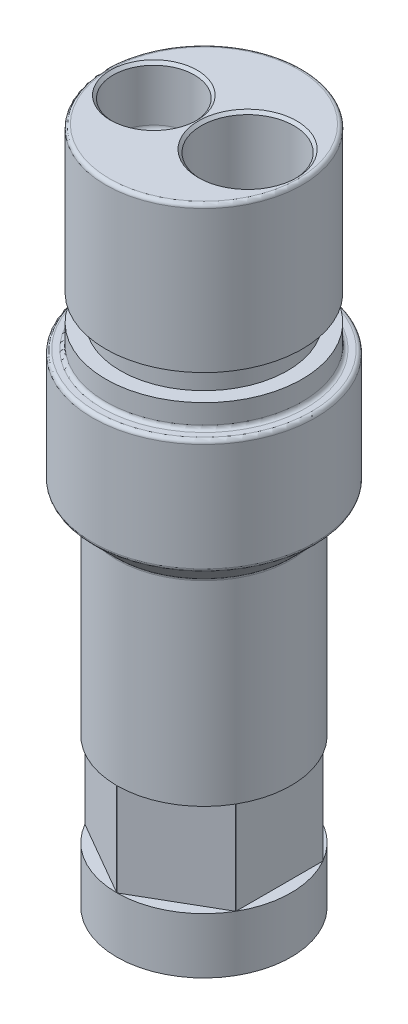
ISO-10303-21;
HEADER;
FILE_DESCRIPTION(('STEP AP214'),'2;1');
FILE_NAME('part.step','',(''),(''),'','','');
FILE_SCHEMA(('AUTOMOTIVE_DESIGN { 1 0 10303 214 1 1 1 1 }'));
ENDSEC;
DATA;
#1=APPLICATION_CONTEXT('core data for automotive mechanical design processes');
#2=APPLICATION_PROTOCOL_DEFINITION('international standard','automotive_design',2000,#1);
#3=PRODUCT_CONTEXT('',#1,'mechanical');
#4=PRODUCT('Part','Part','',(#3));
#5=PRODUCT_RELATED_PRODUCT_CATEGORY('part','',(#4));
#6=PRODUCT_DEFINITION_FORMATION('','',#4);
#7=PRODUCT_DEFINITION_CONTEXT('part definition',#1,'design');
#8=PRODUCT_DEFINITION('design','',#6,#7);
#9=PRODUCT_DEFINITION_SHAPE('','',#8);
#10=(LENGTH_UNIT() NAMED_UNIT(*) SI_UNIT(.MILLI.,.METRE.));
#11=(NAMED_UNIT(*) PLANE_ANGLE_UNIT() SI_UNIT($,.RADIAN.));
#12=(NAMED_UNIT(*) SI_UNIT($,.STERADIAN.) SOLID_ANGLE_UNIT());
#13=UNCERTAINTY_MEASURE_WITH_UNIT(LENGTH_MEASURE(1.E-05),#10,'distance_accuracy_value','');
#14=(GEOMETRIC_REPRESENTATION_CONTEXT(3) GLOBAL_UNCERTAINTY_ASSIGNED_CONTEXT((#13)) GLOBAL_UNIT_ASSIGNED_CONTEXT((#10,
#11,#12)) REPRESENTATION_CONTEXT('',''));
#15=CARTESIAN_POINT('',(0.,0.,0.));
#16=DIRECTION('',(0.,0.,1.));
#17=DIRECTION('',(1.,0.,0.));
#18=AXIS2_PLACEMENT_3D('',#15,#16,#17);
#19=CARTESIAN_POINT('',(0.,0.,0.));
#20=DIRECTION('',(0.,1.,0.));
#21=DIRECTION('',(0.,0.,1.));
#22=AXIS2_PLACEMENT_3D('',#19,#20,#21);
#23=CYLINDRICAL_SURFACE('',#22,11.9126);
#24=CARTESIAN_POINT('',(0.,20.32,0.));
#25=DIRECTION('',(0.,-1.,0.));
#26=DIRECTION('',(0.,0.,-1.));
#27=AXIS2_PLACEMENT_3D('',#24,#25,#26);
#28=CIRCLE('',#27,11.9126);
#29=CARTESIAN_POINT('',(-10.3081074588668,20.32,5.97100991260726));
#30=VERTEX_POINT('',#29);
#31=CARTESIAN_POINT('',(-0.0169925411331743,20.32,11.9125878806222));
#32=VERTEX_POINT('',#31);
#33=EDGE_CURVE('E215',#30,#32,#28,.F.);
#34=ORIENTED_EDGE('',*,*,#33,.T.);
#35=DIRECTION('',(0.,1.,0.));
#36=VECTOR('',#35,1.);
#37=CARTESIAN_POINT('',(-0.0169925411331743,0.,11.9125878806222));
#38=LINE('',#37,#36);
#39=CARTESIAN_POINT('',(-0.0169925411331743,7.62,11.9125878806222));
#40=VERTEX_POINT('',#39);
#41=EDGE_CURVE('E212',#32,#40,#38,.F.);
#42=ORIENTED_EDGE('',*,*,#41,.T.);
#43=CARTESIAN_POINT('',(0.,7.62,0.));
#44=DIRECTION('',(0.,-1.,0.));
#45=DIRECTION('',(0.,0.,-1.));
#46=AXIS2_PLACEMENT_3D('',#43,#44,#45);
#47=CIRCLE('',#46,11.9126);
#48=CARTESIAN_POINT('',(-10.3081074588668,7.62,5.97100991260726));
#49=VERTEX_POINT('',#48);
#50=EDGE_CURVE('E211',#49,#40,#47,.F.);
#51=ORIENTED_EDGE('',*,*,#50,.F.);
#52=DIRECTION('',(0.,1.,0.));
#53=VECTOR('',#52,1.);
#54=CARTESIAN_POINT('',(-10.3081074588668,0.,5.97100991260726));
#55=LINE('',#54,#53);
#56=EDGE_CURVE('E207',#49,#30,#55,.T.);
#57=ORIENTED_EDGE('',*,*,#56,.T.);
#58=EDGE_LOOP('',(#34,#42,#51,#57));
#59=FACE_BOUND('',#58,.T.);
#60=CARTESIAN_POINT('',(10.3251,20.32,5.9415779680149));
#61=VERTEX_POINT('',#60);
#62=CARTESIAN_POINT('',(10.3251,20.32,-5.9415779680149));
#63=VERTEX_POINT('',#62);
#64=EDGE_CURVE('E200',#61,#63,#28,.F.);
#65=ORIENTED_EDGE('',*,*,#64,.T.);
#66=DIRECTION('',(0.,1.,0.));
#67=VECTOR('',#66,1.);
#68=CARTESIAN_POINT('',(10.3251,0.,-5.9415779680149));
#69=LINE('',#68,#67);
#70=CARTESIAN_POINT('',(10.3251,7.62,-5.9415779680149));
#71=VERTEX_POINT('',#70);
#72=EDGE_CURVE('E196',#63,#71,#69,.F.);
#73=ORIENTED_EDGE('',*,*,#72,.T.);
#74=CARTESIAN_POINT('',(10.3251,7.62,5.9415779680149));
#75=VERTEX_POINT('',#74);
#76=EDGE_CURVE('E195',#75,#71,#47,.F.);
#77=ORIENTED_EDGE('',*,*,#76,.F.);
#78=DIRECTION('',(0.,1.,0.));
#79=VECTOR('',#78,1.);
#80=CARTESIAN_POINT('',(10.3251,0.,5.9415779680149));
#81=LINE('',#80,#79);
#82=EDGE_CURVE('E192',#75,#61,#81,.T.);
#83=ORIENTED_EDGE('',*,*,#82,.T.);
#84=EDGE_LOOP('',(#65,#73,#77,#83));
#85=FACE_BOUND('',#84,.T.);
#86=CARTESIAN_POINT('',(-0.0169925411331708,20.32,-11.9125878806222));
#87=VERTEX_POINT('',#86);
#88=CARTESIAN_POINT('',(-10.3081074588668,20.32,-5.97100991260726));
#89=VERTEX_POINT('',#88);
#90=EDGE_CURVE('E167',#87,#89,#28,.F.);
#91=ORIENTED_EDGE('',*,*,#90,.T.);
#92=DIRECTION('',(0.,1.,0.));
#93=VECTOR('',#92,1.);
#94=CARTESIAN_POINT('',(-10.3081074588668,0.,-5.97100991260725));
#95=LINE('',#94,#93);
#96=CARTESIAN_POINT('',(-10.3081074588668,7.62,-5.97100991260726));
#97=VERTEX_POINT('',#96);
#98=EDGE_CURVE('E174',#89,#97,#95,.F.);
#99=ORIENTED_EDGE('',*,*,#98,.T.);
#100=CARTESIAN_POINT('',(-0.0169925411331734,7.62,-11.9125878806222));
#101=VERTEX_POINT('',#100);
#102=EDGE_CURVE('E160',#101,#97,#47,.F.);
#103=ORIENTED_EDGE('',*,*,#102,.F.);
#104=DIRECTION('',(0.,1.,0.));
#105=VECTOR('',#104,1.);
#106=CARTESIAN_POINT('',(-0.0169925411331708,0.,-11.9125878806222));
#107=LINE('',#106,#105);
#108=EDGE_CURVE('E168',#101,#87,#107,.T.);
#109=ORIENTED_EDGE('',*,*,#108,.T.);
#110=EDGE_LOOP('',(#91,#99,#103,#109));
#111=FACE_BOUND('',#110,.T.);
#112=CARTESIAN_POINT('',(0.,0.,0.));
#113=DIRECTION('',(0.,1.,0.));
#114=DIRECTION('',(0.,0.,1.));
#115=AXIS2_PLACEMENT_3D('',#112,#113,#114);
#116=CIRCLE('',#115,11.9126);
#117=CARTESIAN_POINT('',(0.,0.,11.9126));
#118=VERTEX_POINT('',#117);
#119=EDGE_CURVE('E306',#118,#118,#116,.T.);
#120=ORIENTED_EDGE('',*,*,#119,.T.);
#121=EDGE_LOOP('',(#120));
#122=FACE_BOUND('',#121,.T.);
#123=CARTESIAN_POINT('',(0.,47.0517590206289,0.));
#124=DIRECTION('',(0.,1.,0.));
#125=DIRECTION('',(0.,0.,1.));
#126=AXIS2_PLACEMENT_3D('',#123,#124,#125);
#127=CIRCLE('',#126,11.9126);
#128=CARTESIAN_POINT('',(0.,47.0517590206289,11.9126));
#129=VERTEX_POINT('',#128);
#130=EDGE_CURVE('E309',#129,#129,#127,.T.);
#131=ORIENTED_EDGE('',*,*,#130,.F.);
#132=EDGE_LOOP('',(#131));
#133=FACE_BOUND('',#132,.T.);
#134=CARTESIAN_POINT('',(10.3081074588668,20.32,-5.97100991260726));
#135=VERTEX_POINT('',#134);
#136=CARTESIAN_POINT('',(0.0169925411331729,20.32,-11.9125878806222));
#137=VERTEX_POINT('',#136);
#138=EDGE_CURVE('E187',#135,#137,#28,.F.);
#139=ORIENTED_EDGE('',*,*,#138,.T.);
#140=DIRECTION('',(0.,1.,0.));
#141=VECTOR('',#140,1.);
#142=CARTESIAN_POINT('',(0.0169925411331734,0.,-11.9125878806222));
#143=LINE('',#142,#141);
#144=CARTESIAN_POINT('',(0.0169925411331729,7.62,-11.9125878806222));
#145=VERTEX_POINT('',#144);
#146=EDGE_CURVE('E189',#137,#145,#143,.F.);
#147=ORIENTED_EDGE('',*,*,#146,.T.);
#148=CARTESIAN_POINT('',(10.3081074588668,7.62,-5.97100991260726));
#149=VERTEX_POINT('',#148);
#150=EDGE_CURVE('E171',#149,#145,#47,.F.);
#151=ORIENTED_EDGE('',*,*,#150,.F.);
#152=DIRECTION('',(0.,1.,0.));
#153=VECTOR('',#152,1.);
#154=CARTESIAN_POINT('',(10.3081074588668,0.,-5.97100991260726));
#155=LINE('',#154,#153);
#156=EDGE_CURVE('E182',#149,#135,#155,.T.);
#157=ORIENTED_EDGE('',*,*,#156,.T.);
#158=EDGE_LOOP('',(#139,#147,#151,#157));
#159=FACE_BOUND('',#158,.T.);
#160=CARTESIAN_POINT('',(0.0169925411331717,20.32,11.9125878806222));
#161=VERTEX_POINT('',#160);
#162=CARTESIAN_POINT('',(10.3081074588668,20.32,5.97100991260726));
#163=VERTEX_POINT('',#162);
#164=EDGE_CURVE('E208',#161,#163,#28,.F.);
#165=ORIENTED_EDGE('',*,*,#164,.T.);
#166=DIRECTION('',(0.,1.,0.));
#167=VECTOR('',#166,1.);
#168=CARTESIAN_POINT('',(10.3081074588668,0.,5.97100991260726));
#169=LINE('',#168,#167);
#170=CARTESIAN_POINT('',(10.3081074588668,7.62,5.97100991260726));
#171=VERTEX_POINT('',#170);
#172=EDGE_CURVE('E204',#163,#171,#169,.F.);
#173=ORIENTED_EDGE('',*,*,#172,.T.);
#174=CARTESIAN_POINT('',(0.0169925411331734,7.62,11.9125878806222));
#175=VERTEX_POINT('',#174);
#176=EDGE_CURVE('E203',#175,#171,#47,.F.);
#177=ORIENTED_EDGE('',*,*,#176,.F.);
#178=DIRECTION('',(0.,1.,0.));
#179=VECTOR('',#178,1.);
#180=CARTESIAN_POINT('',(0.0169925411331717,0.,11.9125878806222));
#181=LINE('',#180,#179);
#182=EDGE_CURVE('E199',#175,#161,#181,.T.);
#183=ORIENTED_EDGE('',*,*,#182,.T.);
#184=EDGE_LOOP('',(#165,#173,#177,#183));
#185=FACE_BOUND('',#184,.T.);
#186=CARTESIAN_POINT('',(-10.3251,20.32,-5.9415779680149));
#187=VERTEX_POINT('',#186);
#188=CARTESIAN_POINT('',(-10.3251,20.32,5.9415779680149));
#189=VERTEX_POINT('',#188);
#190=EDGE_CURVE('E46',#187,#189,#28,.F.);
#191=ORIENTED_EDGE('',*,*,#190,.T.);
#192=DIRECTION('',(0.,1.,0.));
#193=VECTOR('',#192,1.);
#194=CARTESIAN_POINT('',(-10.3251,0.,5.9415779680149));
#195=LINE('',#194,#193);
#196=CARTESIAN_POINT('',(-10.3251,7.62,5.9415779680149));
#197=VERTEX_POINT('',#196);
#198=EDGE_CURVE('E12',#189,#197,#195,.F.);
#199=ORIENTED_EDGE('',*,*,#198,.T.);
#200=CARTESIAN_POINT('',(-10.3251,7.62,-5.9415779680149));
#201=VERTEX_POINT('',#200);
#202=EDGE_CURVE('E170',#201,#197,#47,.F.);
#203=ORIENTED_EDGE('',*,*,#202,.F.);
#204=DIRECTION('',(0.,1.,0.));
#205=VECTOR('',#204,1.);
#206=CARTESIAN_POINT('',(-10.3251,0.,-5.9415779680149));
#207=LINE('',#206,#205);
#208=EDGE_CURVE('E214',#201,#187,#207,.T.);
#209=ORIENTED_EDGE('',*,*,#208,.T.);
#210=EDGE_LOOP('',(#191,#199,#203,#209));
#211=FACE_BOUND('',#210,.T.);
#212=ADVANCED_FACE('F38',(#59,#85,#111,#122,#133,#159,#185,#211),#23,.T.);
#213=CARTESIAN_POINT('',(0.,0.,0.));
#214=DIRECTION('',(0.,1.,0.));
#215=DIRECTION('',(0.,0.,1.));
#216=AXIS2_PLACEMENT_3D('',#213,#214,#215);
#217=CYLINDRICAL_SURFACE('',#216,5.7531);
#218=CARTESIAN_POINT('',(0.,3.40392789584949,0.));
#219=DIRECTION('',(0.,1.,0.));
#220=DIRECTION('',(0.,0.,1.));
#221=AXIS2_PLACEMENT_3D('',#218,#219,#220);
#222=CIRCLE('',#221,5.75310000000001);
#223=CARTESIAN_POINT('',(0.,3.40392789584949,5.75310000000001));
#224=VERTEX_POINT('',#223);
#225=EDGE_CURVE('E355',#224,#224,#222,.T.);
#226=ORIENTED_EDGE('',*,*,#225,.F.);
#227=EDGE_LOOP('',(#226));
#228=FACE_BOUND('',#227,.T.);
#229=CARTESIAN_POINT('',(5.14388956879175,54.6102,2.57654026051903));
#230=CARTESIAN_POINT('',(5.18629817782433,54.5539828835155,2.49187689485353));
#231=CARTESIAN_POINT('',(5.22658505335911,54.4976561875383,2.40622440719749));
#232=CARTESIAN_POINT('',(5.30285108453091,54.3848226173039,2.23313040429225));
#233=CARTESIAN_POINT('',(5.33882998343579,54.3283157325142,2.14568878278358));
#234=CARTESIAN_POINT('',(5.4064831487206,54.2150462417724,1.96902678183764));
#235=CARTESIAN_POINT('',(5.43814802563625,54.1582833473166,1.87980299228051));
#236=CARTESIAN_POINT('',(5.49702372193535,54.0446815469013,1.69995360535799));
#237=CARTESIAN_POINT('',(5.52423482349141,53.9878426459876,1.60932809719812));
#238=CARTESIAN_POINT('',(5.57394993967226,53.874637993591,1.42760028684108));
#239=CARTESIAN_POINT('',(5.5964910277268,53.818272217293,1.33650812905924));
#240=CARTESIAN_POINT('',(5.63711142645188,53.705659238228,1.15323369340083));
#241=CARTESIAN_POINT('',(5.65518994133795,53.64941205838,1.06105122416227));
#242=CARTESIAN_POINT('',(5.67892018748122,53.5654121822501,0.922078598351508));
#243=CARTESIAN_POINT('',(5.68626167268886,53.5374937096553,0.875671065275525));
#244=CARTESIAN_POINT('',(5.69982011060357,53.4818436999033,0.782575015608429));
#245=CARTESIAN_POINT('',(5.70603699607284,53.4541121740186,0.735886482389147));
#246=CARTESIAN_POINT('',(5.71733966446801,53.3989981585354,0.642193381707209));
#247=CARTESIAN_POINT('',(5.72242588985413,53.3716155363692,0.595188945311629));
#248=CARTESIAN_POINT('',(5.7314658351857,53.3174793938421,0.500713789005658));
#249=CARTESIAN_POINT('',(5.73541972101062,53.2907257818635,0.453243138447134));
#250=CARTESIAN_POINT('',(5.74007386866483,53.2549233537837,0.387344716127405));
#251=CARTESIAN_POINT('',(5.74126413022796,53.2452506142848,0.36929093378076));
#252=CARTESIAN_POINT('',(5.74348275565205,53.2262100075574,0.333010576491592));
#253=CARTESIAN_POINT('',(5.7445111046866,53.216842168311,0.314783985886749));
#254=CARTESIAN_POINT('',(5.74641039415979,53.1984942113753,0.277973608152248));
#255=CARTESIAN_POINT('',(5.74728023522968,53.1895171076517,0.259388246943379));
#256=CARTESIAN_POINT('',(5.74885030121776,53.1722806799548,0.221882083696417));
#257=CARTESIAN_POINT('',(5.74955056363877,53.1640211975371,0.202961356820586));
#258=CARTESIAN_POINT('',(5.75092626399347,53.1467460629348,0.15993583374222));
#259=CARTESIAN_POINT('',(5.75155333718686,53.1380431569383,0.135699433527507));
#260=CARTESIAN_POINT('',(5.75250192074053,53.1241019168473,0.0864521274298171));
#261=CARTESIAN_POINT('',(5.75282714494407,53.1188217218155,0.0614546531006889));
#262=CARTESIAN_POINT('',(5.75306752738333,53.1148815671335,0.0232650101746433));
#263=CARTESIAN_POINT('',(5.75310547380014,53.1142463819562,0.0102821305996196));
#264=CARTESIAN_POINT('',(5.75309326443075,53.1144500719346,-0.0156706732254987));
#265=CARTESIAN_POINT('',(5.75304311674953,53.1152888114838,-0.0286405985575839));
#266=CARTESIAN_POINT('',(5.75285617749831,53.1183348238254,-0.054545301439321));
#267=CARTESIAN_POINT('',(5.75271850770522,53.1205559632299,-0.0674783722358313));
#268=CARTESIAN_POINT('',(5.7523609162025,53.1261107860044,-0.0931014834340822));
#269=CARTESIAN_POINT('',(5.75214094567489,53.1294451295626,-0.105791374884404));
#270=CARTESIAN_POINT('',(5.75151852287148,53.1384704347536,-0.136042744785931));
#271=CARTESIAN_POINT('',(5.75107823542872,53.14456787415,-0.153479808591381));
#272=CARTESIAN_POINT('',(5.75005486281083,53.1578106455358,-0.187952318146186));
#273=CARTESIAN_POINT('',(5.74947163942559,53.1649569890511,-0.204987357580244));
#274=CARTESIAN_POINT('',(5.74751391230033,53.1874085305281,-0.255721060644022));
#275=CARTESIAN_POINT('',(5.74593304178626,53.2036986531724,-0.288970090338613));
#276=CARTESIAN_POINT('',(5.74222872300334,53.2375479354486,-0.355062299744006));
#277=CARTESIAN_POINT('',(5.74010146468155,53.2551153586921,-0.387900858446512));
#278=CARTESIAN_POINT('',(5.73531971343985,53.2908490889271,-0.453138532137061));
#279=CARTESIAN_POINT('',(5.73266613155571,53.3090143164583,-0.485538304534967));
#280=CARTESIAN_POINT('',(5.72395970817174,53.3637501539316,-0.581881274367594));
#281=CARTESIAN_POINT('',(5.71713284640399,53.4008287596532,-0.645465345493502));
#282=CARTESIAN_POINT('',(5.70141514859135,53.4755216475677,-0.772067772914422));
#283=CARTESIAN_POINT('',(5.69252404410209,53.5131359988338,-0.835086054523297));
#284=CARTESIAN_POINT('',(5.67267608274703,53.5886685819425,-0.960704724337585));
#285=CARTESIAN_POINT('',(5.6617170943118,53.6265870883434,-1.0233046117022));
#286=CARTESIAN_POINT('',(5.63774993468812,53.7025488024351,-1.14802753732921));
#287=CARTESIAN_POINT('',(5.62474186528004,53.7405920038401,-1.21015059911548));
#288=CARTESIAN_POINT('',(5.5828071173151,53.8543970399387,-1.39511775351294));
#289=CARTESIAN_POINT('',(5.55086238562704,53.930244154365,-1.51723849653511));
#290=CARTESIAN_POINT('',(5.47901619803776,54.0818264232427,-1.75910349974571));
#291=CARTESIAN_POINT('',(5.43911852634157,54.1575616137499,-1.87884886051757));
#292=CARTESIAN_POINT('',(5.37706348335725,54.2646686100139,-2.04648750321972));
#293=CARTESIAN_POINT('',(5.35813998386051,54.2961387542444,-2.09553346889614));
#294=CARTESIAN_POINT('',(5.31894525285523,54.359032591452,-2.19311308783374));
#295=CARTESIAN_POINT('',(5.29867407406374,54.3904562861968,-2.24164676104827));
#296=CARTESIAN_POINT('',(5.25676044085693,54.453301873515,-2.33824850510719));
#297=CARTESIAN_POINT('',(5.23511577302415,54.4847236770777,-2.38631567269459));
#298=CARTESIAN_POINT('',(5.19049674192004,54.5475081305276,-2.48187106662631));
#299=CARTESIAN_POINT('',(5.1675223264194,54.5788707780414,-2.52935927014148));
#300=CARTESIAN_POINT('',(5.14388956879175,54.6102,-2.57654026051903));
#301=B_SPLINE_CURVE_WITH_KNOTS('',3,(#229,#230,#231,#232,#233,#234,#235,#236,#237,#238,#239,
#240,#241,#242,#243,#244,#245,#246,#247,#248,#249,#250,#251,#252,#253,#254,#255,#256,#257,#258,
#259,#260,#261,#262,#263,#264,#265,#266,#267,#268,#269,#270,#271,#272,#273,#274,#275,#276,#277,
#278,#279,#280,#281,#282,#283,#284,#285,#286,#287,#288,#289,#290,#291,#292,#293,#294,#295,#296,
#297,#298,#299,#300),.UNSPECIFIED.,.F.,.F.,(4,2,2,2,2,2,2,2,2,2,2,2,2,2,2,2,2,2,2,2,2,2,2,2,2,2,
2,2,2,2,2,2,2,2,2,4),(0.,0.33033856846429,0.660696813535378,0.991762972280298,1.32280814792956,
1.65111504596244,1.97948044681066,2.14343074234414,2.30739083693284,2.47128665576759,
2.63515845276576,2.69670476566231,2.75825671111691,2.82022053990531,2.88217065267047,
2.95934049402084,3.03554776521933,3.07446159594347,3.11337184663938,3.15267883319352,
3.192009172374,3.24738350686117,3.30281159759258,3.41391576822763,3.52581677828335,
3.63752575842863,3.85924846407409,4.0810000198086,4.30298141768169,4.52495179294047,
4.96649577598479,5.40783016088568,5.5916262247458,5.77541510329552,5.95950807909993,
6.14360829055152),.UNSPECIFIED.);
#302=CARTESIAN_POINT('',(5.14404042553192,54.61,2.57623906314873));
#303=VERTEX_POINT('',#302);
#304=CARTESIAN_POINT('',(5.14404042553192,54.61,-2.57623906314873));
#305=VERTEX_POINT('',#304);
#306=EDGE_CURVE('E492',#303,#305,#301,.T.);
#307=ORIENTED_EDGE('',*,*,#306,.T.);
#308=DIRECTION('',(0.,1.,0.));
#309=VECTOR('',#308,1.);
#310=CARTESIAN_POINT('',(5.14404042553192,64.77,-2.57623906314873));
#311=LINE('',#310,#309);
#312=CARTESIAN_POINT('',(5.14404042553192,66.5594530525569,-2.57623906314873));
#313=VERTEX_POINT('',#312);
#314=EDGE_CURVE('E285',#305,#313,#311,.T.);
#315=ORIENTED_EDGE('',*,*,#314,.T.);
#316=CARTESIAN_POINT('',(0.,66.5594530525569,0.));
#317=DIRECTION('',(0.,1.,0.));
#318=DIRECTION('',(0.,0.,1.));
#319=AXIS2_PLACEMENT_3D('',#316,#317,#318);
#320=CIRCLE('',#319,5.7531);
#321=CARTESIAN_POINT('',(-5.3086,66.5594530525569,-2.21741418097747));
#322=VERTEX_POINT('',#321);
#323=EDGE_CURVE('E351',#313,#322,#320,.T.);
#324=ORIENTED_EDGE('',*,*,#323,.T.);
#325=DIRECTION('',(0.,1.,0.));
#326=VECTOR('',#325,1.);
#327=CARTESIAN_POINT('',(-5.3086,69.5325,-2.21741418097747));
#328=LINE('',#327,#326);
#329=CARTESIAN_POINT('',(-5.3086,54.61,-2.21741418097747));
#330=VERTEX_POINT('',#329);
#331=EDGE_CURVE('E300',#322,#330,#328,.F.);
#332=ORIENTED_EDGE('',*,*,#331,.T.);
#333=CARTESIAN_POINT('',(-5.30846869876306,54.6102000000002,-2.21772849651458));
#334=CARTESIAN_POINT('',(-5.32916084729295,54.5786854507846,-2.16819738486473));
#335=CARTESIAN_POINT('',(-5.3491826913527,54.5472709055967,-2.11832460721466));
#336=CARTESIAN_POINT('',(-5.38787479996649,54.4847119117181,-2.0178855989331));
#337=CARTESIAN_POINT('',(-5.40654498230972,54.4535674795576,-1.96731932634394));
#338=CARTESIAN_POINT('',(-5.46059009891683,54.3605087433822,-1.81434158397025));
#339=CARTESIAN_POINT('',(-5.49390494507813,54.2991136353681,-1.71087740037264));
#340=CARTESIAN_POINT('',(-5.55627306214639,54.1759818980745,-1.49633772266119));
#341=CARTESIAN_POINT('',(-5.58507389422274,54.1143494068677,-1.3851277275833));
#342=CARTESIAN_POINT('',(-5.62353309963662,54.0254023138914,-1.21547809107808));
#343=CARTESIAN_POINT('',(-5.63555835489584,53.9963485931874,-1.15848080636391));
#344=CARTESIAN_POINT('',(-5.65799824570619,53.9398519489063,-1.04338607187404));
#345=CARTESIAN_POINT('',(-5.66841318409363,53.9124087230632,-0.985288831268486));
#346=CARTESIAN_POINT('',(-5.68651545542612,53.8626902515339,-0.874355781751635));
#347=CARTESIAN_POINT('',(-5.69437738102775,53.8401798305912,-0.821654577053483));
#348=CARTESIAN_POINT('',(-5.70873895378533,53.7975558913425,-0.715087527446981));
#349=CARTESIAN_POINT('',(-5.71523841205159,53.7774427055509,-0.661221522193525));
#350=CARTESIAN_POINT('',(-5.72674008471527,53.7406665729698,-0.552766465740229));
#351=CARTESIAN_POINT('',(-5.73175685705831,53.7239706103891,-0.498190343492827));
#352=CARTESIAN_POINT('',(-5.74028237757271,53.694849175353,-0.387786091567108));
#353=CARTESIAN_POINT('',(-5.74379180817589,53.6824217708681,-0.331958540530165));
#354=CARTESIAN_POINT('',(-5.74864450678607,53.6649609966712,-0.230783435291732));
#355=CARTESIAN_POINT('',(-5.75028373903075,53.6589360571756,-0.185623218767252));
#356=CARTESIAN_POINT('',(-5.75249547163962,53.6507666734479,-0.0949277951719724));
#357=CARTESIAN_POINT('',(-5.75306823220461,53.648621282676,-0.0493926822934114));
#358=CARTESIAN_POINT('',(-5.75312918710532,53.6483940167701,0.0416863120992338));
#359=CARTESIAN_POINT('',(-5.75261744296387,53.6503119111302,0.0872301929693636));
#360=CARTESIAN_POINT('',(-5.7505261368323,53.6580441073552,0.17796072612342));
#361=CARTESIAN_POINT('',(-5.74894632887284,53.6638593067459,0.223147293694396));
#362=CARTESIAN_POINT('',(-5.74386839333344,53.6821654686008,0.332023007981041));
#363=CARTESIAN_POINT('',(-5.73983949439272,53.6964457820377,0.395384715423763));
#364=CARTESIAN_POINT('',(-5.72985117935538,53.7303747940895,0.520494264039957));
#365=CARTESIAN_POINT('',(-5.72389011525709,53.7500280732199,0.582240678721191));
#366=CARTESIAN_POINT('',(-5.71009364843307,53.7934336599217,0.704870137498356));
#367=CARTESIAN_POINT('',(-5.70223679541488,53.8172319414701,0.765734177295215));
#368=CARTESIAN_POINT('',(-5.68478316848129,53.8676108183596,0.886057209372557));
#369=CARTESIAN_POINT('',(-5.6751856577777,53.8941925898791,0.945515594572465));
#370=CARTESIAN_POINT('',(-5.65502088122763,53.9474693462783,1.0592473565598));
#371=CARTESIAN_POINT('',(-5.64456226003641,53.9740364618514,1.11360049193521));
#372=CARTESIAN_POINT('',(-5.62222619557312,54.0284373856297,1.22137623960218));
#373=CARTESIAN_POINT('',(-5.61034858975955,54.0562713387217,1.27479874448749));
#374=CARTESIAN_POINT('',(-5.57261272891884,54.1412050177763,1.43389078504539));
#375=CARTESIAN_POINT('',(-5.54466272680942,54.1997060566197,1.53832176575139));
#376=CARTESIAN_POINT('',(-5.48462606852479,54.3163347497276,1.74000832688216));
#377=CARTESIAN_POINT('',(-5.45276161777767,54.3743754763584,1.83738126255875));
#378=CARTESIAN_POINT('',(-5.40133566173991,54.4622870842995,1.98149627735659));
#379=CARTESIAN_POINT('',(-5.38360443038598,54.49170882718,2.02917318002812));
#380=CARTESIAN_POINT('',(-5.34693745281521,54.5507905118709,2.12391113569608));
#381=CARTESIAN_POINT('',(-5.32800172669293,54.5804504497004,2.17097219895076));
#382=CARTESIAN_POINT('',(-5.30846869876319,54.6102,2.21772849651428));
#383=B_SPLINE_CURVE_WITH_KNOTS('',3,(#333,#334,#335,#336,#337,#338,#339,#340,#341,#342,#343,
#344,#345,#346,#347,#348,#349,#350,#351,#352,#353,#354,#355,#356,#357,#358,#359,#360,#361,#362,
#363,#364,#365,#366,#367,#368,#369,#370,#371,#372,#373,#374,#375,#376,#377,#378,#379,#380,#381,
#382),.UNSPECIFIED.,.F.,.F.,(4,2,2,2,2,2,2,2,2,2,2,2,2,2,2,2,2,2,2,2,2,2,2,2,4),(0.,
0.186732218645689,0.37347578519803,0.74781600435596,1.13864966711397,1.33389920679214,
1.52911198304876,1.70258458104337,1.87608121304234,2.04781297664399,2.21946690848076,
2.35607641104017,2.49265257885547,2.62922099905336,2.76582088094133,2.96067550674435,
3.15569676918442,3.35303763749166,3.55046223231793,3.73460799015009,3.91877486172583,
4.28732114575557,4.64043613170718,4.81671177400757,4.99298447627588),.UNSPECIFIED.);
#384=CARTESIAN_POINT('',(-5.30860000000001,54.61,2.21741418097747));
#385=VERTEX_POINT('',#384);
#386=EDGE_CURVE('E385',#330,#385,#383,.T.);
#387=ORIENTED_EDGE('',*,*,#386,.T.);
#388=DIRECTION('',(0.,1.,0.));
#389=VECTOR('',#388,1.);
#390=CARTESIAN_POINT('',(-5.3086,69.5325,2.21741418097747));
#391=LINE('',#390,#389);
#392=CARTESIAN_POINT('',(-5.3086,66.5594530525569,2.21741418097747));
#393=VERTEX_POINT('',#392);
#394=EDGE_CURVE('E303',#385,#393,#391,.T.);
#395=ORIENTED_EDGE('',*,*,#394,.T.);
#396=CARTESIAN_POINT('',(5.14404042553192,66.5594530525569,2.57623906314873));
#397=VERTEX_POINT('',#396);
#398=EDGE_CURVE('E352',#393,#397,#320,.T.);
#399=ORIENTED_EDGE('',*,*,#398,.T.);
#400=DIRECTION('',(0.,1.,0.));
#401=VECTOR('',#400,1.);
#402=CARTESIAN_POINT('',(5.14404042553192,64.77,2.57623906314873));
#403=LINE('',#402,#401);
#404=EDGE_CURVE('E282',#397,#303,#403,.F.);
#405=ORIENTED_EDGE('',*,*,#404,.T.);
#406=EDGE_LOOP('',(#307,#315,#324,#332,#387,#395,#399,#405));
#407=FACE_BOUND('',#406,.T.);
#408=ADVANCED_FACE('F411',(#228,#407),#217,.F.);
#409=CARTESIAN_POINT('',(0.,66.5594530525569,0.));
#410=DIRECTION('',(0.,-1.,0.));
#411=DIRECTION('',(0.,0.,-1.));
#412=AXIS2_PLACEMENT_3D('',#409,#410,#411);
#413=CONICAL_SURFACE('',#412,5.7531,1.02974425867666);
#414=CARTESIAN_POINT('',(0.,70.0162642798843,0.));
#415=VERTEX_POINT('',#414);
#416=VERTEX_LOOP('',#415);
#417=FACE_BOUND('',#416,.T.);
#418=ORIENTED_EDGE('',*,*,#323,.F.);
#419=CARTESIAN_POINT('',(5.1443612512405,66.5592530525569,-2.57634177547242));
#420=CARTESIAN_POINT('',(5.05038281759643,66.6178184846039,-2.54626043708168));
#421=CARTESIAN_POINT('',(4.9582632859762,66.6767492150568,-2.51110667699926));
#422=CARTESIAN_POINT('',(4.77847990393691,66.7948628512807,-2.43103177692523));
#423=CARTESIAN_POINT('',(4.6908178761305,66.8540458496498,-2.38610668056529));
#424=CARTESIAN_POINT('',(4.51977045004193,66.9728278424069,-2.2863114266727));
#425=CARTESIAN_POINT('',(4.43644706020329,67.032423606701,-2.23133110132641));
#426=CARTESIAN_POINT('',(4.27597048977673,67.1506689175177,-2.11215619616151));
#427=CARTESIAN_POINT('',(4.19881581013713,67.2093186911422,-2.04796386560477));
#428=CARTESIAN_POINT('',(4.05951046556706,67.3185156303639,-1.9181913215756));
#429=CARTESIAN_POINT('',(3.99664220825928,67.3692461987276,-1.85353473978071));
#430=CARTESIAN_POINT('',(3.87694494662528,67.4685586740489,-1.71729321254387));
#431=CARTESIAN_POINT('',(3.82011708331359,67.5171401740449,-1.64570696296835));
#432=CARTESIAN_POINT('',(3.71342118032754,67.6109087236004,-1.49610478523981));
#433=CARTESIAN_POINT('',(3.66352047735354,67.6561112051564,-1.41812199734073));
#434=CARTESIAN_POINT('',(3.57114852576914,67.7420180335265,-1.25562847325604));
#435=CARTESIAN_POINT('',(3.52867117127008,67.7827260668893,-1.17112318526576));
#436=CARTESIAN_POINT('',(3.44621862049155,67.8636444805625,-0.982480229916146));
#437=CARTESIAN_POINT('',(3.40758906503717,67.9028521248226,-0.877304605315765));
#438=CARTESIAN_POINT('',(3.34311156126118,67.969648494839,-0.659636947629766));
#439=CARTESIAN_POINT('',(3.31724466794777,67.9972544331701,-0.547156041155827));
#440=CARTESIAN_POINT('',(3.27984304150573,68.0375642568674,-0.315931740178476));
#441=CARTESIAN_POINT('',(3.26844999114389,68.0501207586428,-0.197138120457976));
#442=CARTESIAN_POINT('',(3.26159032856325,68.0576488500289,0.041458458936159));
#443=CARTESIAN_POINT('',(3.26611663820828,68.0526282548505,0.161260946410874));
#444=CARTESIAN_POINT('',(3.28901943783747,68.0276769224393,0.382115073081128));
#445=CARTESIAN_POINT('',(3.30554950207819,68.009736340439,0.483604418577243));
#446=CARTESIAN_POINT('',(3.34925249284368,67.9633362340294,0.681763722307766));
#447=CARTESIAN_POINT('',(3.37643469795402,67.934867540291,0.778429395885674));
#448=CARTESIAN_POINT('',(3.45472155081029,67.8550722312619,1.00831069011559));
#449=CARTESIAN_POINT('',(3.51108375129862,67.7992380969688,1.13815947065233));
#450=CARTESIAN_POINT('',(3.64049511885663,67.6768206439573,1.38383123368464));
#451=CARTESIAN_POINT('',(3.7135839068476,67.6102119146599,1.49961989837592));
#452=CARTESIAN_POINT('',(3.84525206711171,67.4955949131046,1.67772468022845));
#453=CARTESIAN_POINT('',(3.89969432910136,67.449436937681,1.74437189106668));
#454=CARTESIAN_POINT('',(4.01391955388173,67.3552635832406,1.87150703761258));
#455=CARTESIAN_POINT('',(4.07370415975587,67.3072476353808,1.93199306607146));
#456=CARTESIAN_POINT('',(4.2603088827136,67.1614389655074,2.10392664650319));
#457=CARTESIAN_POINT('',(4.39450919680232,67.0617715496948,2.2060221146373));
#458=CARTESIAN_POINT('',(4.63165214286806,66.8944557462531,2.35407527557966));
#459=CARTESIAN_POINT('',(4.73030721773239,66.8270878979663,2.40744255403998));
#460=CARTESIAN_POINT('',(4.93328852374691,66.6927536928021,2.50146257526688));
#461=CARTESIAN_POINT('',(5.03759762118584,66.6257867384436,2.54215145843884));
#462=CARTESIAN_POINT('',(5.1443612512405,66.5592530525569,2.57634177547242));
#463=B_SPLINE_CURVE_WITH_KNOTS('',3,(#419,#420,#421,#422,#423,#424,#425,#426,#427,#428,#429,
#430,#431,#432,#433,#434,#435,#436,#437,#438,#439,#440,#441,#442,#443,#444,#445,#446,#447,#448,
#449,#450,#451,#452,#453,#454,#455,#456,#457,#458,#459,#460,#461,#462),.UNSPECIFIED.,.F.,.F.,(4,
2,2,2,2,2,2,2,2,2,2,2,2,2,2,2,2,2,2,2,2,4),(0.,0.344103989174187,0.688347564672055,
1.03661725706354,1.38480205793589,1.69481609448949,2.00488858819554,2.31344537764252,
2.62174716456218,2.97658821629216,3.33090094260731,3.68865592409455,4.04625185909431,
4.35808877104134,4.67019791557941,5.12422473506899,5.5793383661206,5.87195373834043,
6.16465941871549,6.7493483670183,7.14121062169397,7.53194541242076),.UNSPECIFIED.);
#464=EDGE_CURVE('E549',#313,#397,#463,.T.);
#465=ORIENTED_EDGE('',*,*,#464,.T.);
#466=ORIENTED_EDGE('',*,*,#398,.F.);
#467=CARTESIAN_POINT('',(-5.30887923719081,66.5592530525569,2.21760926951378));
#468=CARTESIAN_POINT('',(-5.24417249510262,66.6055849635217,2.17240142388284));
#469=CARTESIAN_POINT('',(-5.18126452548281,66.6515841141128,2.12424818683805));
#470=CARTESIAN_POINT('',(-5.05938759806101,66.7425038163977,2.02210216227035));
#471=CARTESIAN_POINT('',(-5.00042314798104,66.7874230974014,1.96810287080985));
#472=CARTESIAN_POINT('',(-4.88638881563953,66.8760782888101,1.85388398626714));
#473=CARTESIAN_POINT('',(-4.83136073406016,66.9197991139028,1.79361071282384));
#474=CARTESIAN_POINT('',(-4.72632900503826,67.0049538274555,1.6674180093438));
#475=CARTESIAN_POINT('',(-4.67632285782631,67.0463888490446,1.60150141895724));
#476=CARTESIAN_POINT('',(-4.55601195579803,67.148065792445,1.42654794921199));
#477=CARTESIAN_POINT('',(-4.48951500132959,67.206236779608,1.3136040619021));
#478=CARTESIAN_POINT('',(-4.37232922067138,67.3114609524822,1.07542004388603));
#479=CARTESIAN_POINT('',(-4.32158399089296,67.358553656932,0.950225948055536));
#480=CARTESIAN_POINT('',(-4.24659545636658,67.4294547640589,0.714379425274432));
#481=CARTESIAN_POINT('',(-4.21912565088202,67.4560042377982,0.605592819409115));
#482=CARTESIAN_POINT('',(-4.17778861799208,67.4962927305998,0.383139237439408));
#483=CARTESIAN_POINT('',(-4.16391125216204,67.510041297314,0.269475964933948));
#484=CARTESIAN_POINT('',(-4.15074929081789,67.5230750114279,0.0400336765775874));
#485=CARTESIAN_POINT('',(-4.15151763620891,67.5223076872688,-0.0757515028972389));
#486=CARTESIAN_POINT('',(-4.16771631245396,67.5062807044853,-0.305273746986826));
#487=CARTESIAN_POINT('',(-4.18315267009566,67.4910150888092,-0.419009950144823));
#488=CARTESIAN_POINT('',(-4.22648825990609,67.4488914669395,-0.635904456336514));
#489=CARTESIAN_POINT('',(-4.25375768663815,67.4226213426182,-0.739308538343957));
#490=CARTESIAN_POINT('',(-4.31917194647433,67.360908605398,-0.939706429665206));
#491=CARTESIAN_POINT('',(-4.35732368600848,67.3254601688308,-1.03669611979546));
#492=CARTESIAN_POINT('',(-4.46455138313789,67.2282127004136,-1.26990908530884));
#493=CARTESIAN_POINT('',(-4.53956417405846,67.1620845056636,-1.40160354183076));
#494=CARTESIAN_POINT('',(-4.70727526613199,67.020119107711,-1.64747306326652));
#495=CARTESIAN_POINT('',(-4.80001094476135,66.944261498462,-1.76161016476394));
#496=CARTESIAN_POINT('',(-4.96298770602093,66.816177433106,-1.93256609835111));
#497=CARTESIAN_POINT('',(-5.02882066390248,66.7656174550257,-1.99494633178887));
#498=CARTESIAN_POINT('',(-5.16531487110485,66.6632606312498,-2.11196676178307));
#499=CARTESIAN_POINT('',(-5.23594678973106,66.6114723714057,-2.16664863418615));
#500=CARTESIAN_POINT('',(-5.30887923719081,66.5592530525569,-2.21760926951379));
#501=B_SPLINE_CURVE_WITH_KNOTS('',3,(#467,#468,#469,#470,#471,#472,#473,#474,#475,#476,#477,
#478,#479,#480,#481,#482,#483,#484,#485,#486,#487,#488,#489,#490,#491,#492,#493,#494,#495,#496,
#497,#498,#499,#500),.UNSPECIFIED.,.F.,.F.,(4,2,2,2,2,2,2,2,2,2,2,2,2,2,2,2,4),(0.,
0.27453890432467,0.549386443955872,0.826816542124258,1.10410785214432,1.53266439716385,
1.95966818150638,2.3041464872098,2.64836765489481,2.99383333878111,3.33944102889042,
3.66855816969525,3.99788465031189,4.49129211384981,4.98575188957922,5.29688043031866,
5.60625392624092),.UNSPECIFIED.);
#502=EDGE_CURVE('E376',#393,#322,#501,.T.);
#503=ORIENTED_EDGE('',*,*,#502,.T.);
#504=EDGE_LOOP('',(#418,#465,#466,#503));
#505=FACE_BOUND('',#504,.T.);
#506=ADVANCED_FACE('F393',(#417,#505),#413,.F.);
#507=CARTESIAN_POINT('',(-12.92225,92.71,0.));
#508=DIRECTION('',(0.,1.,0.));
#509=DIRECTION('',(0.,0.,1.));
#510=AXIS2_PLACEMENT_3D('',#507,#508,#509);
#511=PLANE('',#510);
#512=CARTESIAN_POINT('',(5.96899999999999,92.71,0.));
#513=DIRECTION('',(0.,1.,0.));
#514=DIRECTION('',(0.,0.,1.));
#515=AXIS2_PLACEMENT_3D('',#512,#513,#514);
#516=CIRCLE('',#515,6.73099999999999);
#517=CARTESIAN_POINT('',(5.96899999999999,92.71,6.73099999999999));
#518=VERTEX_POINT('',#517);
#519=EDGE_CURVE('E479',#518,#518,#516,.F.);
#520=ORIENTED_EDGE('',*,*,#519,.T.);
#521=EDGE_LOOP('',(#520));
#522=FACE_BOUND('',#521,.T.);
#523=CARTESIAN_POINT('',(-6.85800000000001,92.71,0.));
#524=DIRECTION('',(0.,1.,0.));
#525=DIRECTION('',(0.,0.,1.));
#526=AXIS2_PLACEMENT_3D('',#523,#524,#525);
#527=CIRCLE('',#526,5.93090000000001);
#528=CARTESIAN_POINT('',(-6.85800000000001,92.71,5.9309));
#529=VERTEX_POINT('',#528);
#530=EDGE_CURVE('E483',#529,#529,#527,.F.);
#531=ORIENTED_EDGE('',*,*,#530,.T.);
#532=EDGE_LOOP('',(#531));
#533=FACE_BOUND('',#532,.T.);
#534=CARTESIAN_POINT('',(0.,92.71,0.));
#535=DIRECTION('',(0.,1.,0.));
#536=DIRECTION('',(0.,0.,1.));
#537=AXIS2_PLACEMENT_3D('',#534,#535,#536);
#538=CIRCLE('',#537,12.92225);
#539=CARTESIAN_POINT('',(0.,92.71,12.92225));
#540=VERTEX_POINT('',#539);
#541=EDGE_CURVE('E348',#540,#540,#538,.T.);
#542=ORIENTED_EDGE('',*,*,#541,.T.);
#543=EDGE_LOOP('',(#542));
#544=FACE_BOUND('',#543,.T.);
#545=ADVANCED_FACE('F464',(#522,#533,#544),#511,.T.);
#546=CARTESIAN_POINT('',(-11.9126,0.,0.));
#547=DIRECTION('',(0.,-1.,0.));
#548=DIRECTION('',(0.,0.,-1.));
#549=AXIS2_PLACEMENT_3D('',#546,#547,#548);
#550=PLANE('',#549);
#551=CARTESIAN_POINT('',(0.,0.,0.));
#552=DIRECTION('',(0.,1.,0.));
#553=DIRECTION('',(0.,0.,1.));
#554=AXIS2_PLACEMENT_3D('',#551,#552,#553);
#555=CIRCLE('',#554,11.1506);
#556=CARTESIAN_POINT('',(0.,0.,11.1506));
#557=VERTEX_POINT('',#556);
#558=EDGE_CURVE('E373',#557,#557,#555,.T.);
#559=ORIENTED_EDGE('',*,*,#558,.T.);
#560=EDGE_LOOP('',(#559));
#561=FACE_BOUND('',#560,.T.);
#562=ORIENTED_EDGE('',*,*,#119,.F.);
#563=EDGE_LOOP('',(#562));
#564=FACE_BOUND('',#563,.T.);
#565=ADVANCED_FACE('F466',(#561,#564),#550,.T.);
#566=CARTESIAN_POINT('',(0.,0.,0.));
#567=DIRECTION('',(0.,1.,0.));
#568=DIRECTION('',(0.,0.,1.));
#569=AXIS2_PLACEMENT_3D('',#566,#567,#568);
#570=CYLINDRICAL_SURFACE('',#569,11.1506);
#571=CARTESIAN_POINT('',(0.,1.27,0.));
#572=DIRECTION('',(0.,1.,0.));
#573=DIRECTION('',(0.,0.,1.));
#574=AXIS2_PLACEMENT_3D('',#571,#572,#573);
#575=CIRCLE('',#574,11.1506);
#576=CARTESIAN_POINT('',(0.,1.27,11.1506));
#577=VERTEX_POINT('',#576);
#578=EDGE_CURVE('E370',#577,#577,#575,.T.);
#579=ORIENTED_EDGE('',*,*,#578,.T.);
#580=EDGE_LOOP('',(#579));
#581=FACE_BOUND('',#580,.T.);
#582=ORIENTED_EDGE('',*,*,#558,.F.);
#583=EDGE_LOOP('',(#582));
#584=FACE_BOUND('',#583,.T.);
#585=ADVANCED_FACE('F472',(#581,#584),#570,.F.);
#586=CARTESIAN_POINT('',(-11.1506,1.27,0.));
#587=DIRECTION('',(0.,-1.,0.));
#588=DIRECTION('',(0.,0.,-1.));
#589=AXIS2_PLACEMENT_3D('',#586,#587,#588);
#590=PLANE('',#589);
#591=CARTESIAN_POINT('',(0.,1.27,0.));
#592=DIRECTION('',(0.,1.,0.));
#593=DIRECTION('',(0.,0.,1.));
#594=AXIS2_PLACEMENT_3D('',#591,#592,#593);
#595=CIRCLE('',#594,8.58520000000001);
#596=CARTESIAN_POINT('',(0.,1.27,8.58520000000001));
#597=VERTEX_POINT('',#596);
#598=EDGE_CURVE('E367',#597,#597,#595,.T.);
#599=ORIENTED_EDGE('',*,*,#598,.T.);
#600=EDGE_LOOP('',(#599));
#601=FACE_BOUND('',#600,.T.);
#602=ORIENTED_EDGE('',*,*,#578,.F.);
#603=EDGE_LOOP('',(#602));
#604=FACE_BOUND('',#603,.T.);
#605=ADVANCED_FACE('F521',(#601,#604),#590,.T.);
#606=CARTESIAN_POINT('',(0.,0.,0.));
#607=DIRECTION('',(0.,1.,0.));
#608=DIRECTION('',(0.,0.,1.));
#609=AXIS2_PLACEMENT_3D('',#606,#607,#608);
#610=CYLINDRICAL_SURFACE('',#609,8.58520000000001);
#611=CARTESIAN_POINT('',(0.,0.,0.));
#612=DIRECTION('',(0.,1.,0.));
#613=DIRECTION('',(0.,0.,1.));
#614=AXIS2_PLACEMENT_3D('',#611,#612,#613);
#615=CIRCLE('',#614,8.58520000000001);
#616=CARTESIAN_POINT('',(0.,0.,8.58520000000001));
#617=VERTEX_POINT('',#616);
#618=EDGE_CURVE('E364',#617,#617,#615,.T.);
#619=ORIENTED_EDGE('',*,*,#618,.T.);
#620=EDGE_LOOP('',(#619));
#621=FACE_BOUND('',#620,.T.);
#622=ORIENTED_EDGE('',*,*,#598,.F.);
#623=EDGE_LOOP('',(#622));
#624=FACE_BOUND('',#623,.T.);
#625=ADVANCED_FACE('F525',(#621,#624),#610,.T.);
#626=CARTESIAN_POINT('',(-8.58520000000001,0.,0.));
#627=DIRECTION('',(0.,-1.,0.));
#628=DIRECTION('',(0.,0.,-1.));
#629=AXIS2_PLACEMENT_3D('',#626,#627,#628);
#630=PLANE('',#629);
#631=CARTESIAN_POINT('',(0.,0.,0.));
#632=DIRECTION('',(0.,1.,0.));
#633=DIRECTION('',(0.,0.,1.));
#634=AXIS2_PLACEMENT_3D('',#631,#632,#633);
#635=CIRCLE('',#634,6.13409999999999);
#636=CARTESIAN_POINT('',(0.,0.,6.13409999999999));
#637=VERTEX_POINT('',#636);
#638=EDGE_CURVE('E361',#637,#637,#635,.T.);
#639=ORIENTED_EDGE('',*,*,#638,.T.);
#640=EDGE_LOOP('',(#639));
#641=FACE_BOUND('',#640,.T.);
#642=ORIENTED_EDGE('',*,*,#618,.F.);
#643=EDGE_LOOP('',(#642));
#644=FACE_BOUND('',#643,.T.);
#645=ADVANCED_FACE('F529',(#641,#644),#630,.T.);
#646=CARTESIAN_POINT('',(0.,0.,0.));
#647=DIRECTION('',(0.,1.,0.));
#648=DIRECTION('',(0.,0.,1.));
#649=AXIS2_PLACEMENT_3D('',#646,#647,#648);
#650=CYLINDRICAL_SURFACE('',#649,6.13409999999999);
#651=CARTESIAN_POINT('',(0.,3.175,0.));
#652=DIRECTION('',(0.,1.,0.));
#653=DIRECTION('',(0.,0.,1.));
#654=AXIS2_PLACEMENT_3D('',#651,#652,#653);
#655=CIRCLE('',#654,6.13409999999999);
#656=CARTESIAN_POINT('',(0.,3.175,6.13409999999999));
#657=VERTEX_POINT('',#656);
#658=EDGE_CURVE('E358',#657,#657,#655,.T.);
#659=ORIENTED_EDGE('',*,*,#658,.T.);
#660=EDGE_LOOP('',(#659));
#661=FACE_BOUND('',#660,.T.);
#662=ORIENTED_EDGE('',*,*,#638,.F.);
#663=EDGE_LOOP('',(#662));
#664=FACE_BOUND('',#663,.T.);
#665=ADVANCED_FACE('F533',(#661,#664),#650,.F.);
#666=CARTESIAN_POINT('',(0.,3.175,0.));
#667=DIRECTION('',(0.,-1.,0.));
#668=DIRECTION('',(0.,0.,-1.));
#669=AXIS2_PLACEMENT_3D('',#666,#667,#668);
#670=CONICAL_SURFACE('',#669,6.13409999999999,1.02974425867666);
#671=ORIENTED_EDGE('',*,*,#225,.T.);
#672=EDGE_LOOP('',(#671));
#673=FACE_BOUND('',#672,.T.);
#674=ORIENTED_EDGE('',*,*,#658,.F.);
#675=EDGE_LOOP('',(#674));
#676=FACE_BOUND('',#675,.T.);
#677=ADVANCED_FACE('F462',(#673,#676),#670,.F.);
#678=CARTESIAN_POINT('',(0.,92.202,0.));
#679=DIRECTION('',(0.,1.,0.));
#680=DIRECTION('',(0.,0.,1.));
#681=AXIS2_PLACEMENT_3D('',#678,#679,#680);
#682=TOROIDAL_SURFACE('',#681,12.92225,0.507999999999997);
#683=CARTESIAN_POINT('',(0.,92.202,0.));
#684=DIRECTION('',(0.,1.,0.));
#685=DIRECTION('',(0.,0.,1.));
#686=AXIS2_PLACEMENT_3D('',#683,#684,#685);
#687=CIRCLE('',#686,13.43025);
#688=CARTESIAN_POINT('',(0.,92.202,13.43025));
#689=VERTEX_POINT('',#688);
#690=EDGE_CURVE('E345',#689,#689,#687,.T.);
#691=ORIENTED_EDGE('',*,*,#690,.T.);
#692=EDGE_LOOP('',(#691));
#693=FACE_BOUND('',#692,.T.);
#694=ORIENTED_EDGE('',*,*,#541,.F.);
#695=EDGE_LOOP('',(#694));
#696=FACE_BOUND('',#695,.T.);
#697=ADVANCED_FACE('F459',(#693,#696),#682,.T.);
#698=CARTESIAN_POINT('',(0.,0.,0.));
#699=DIRECTION('',(0.,1.,0.));
#700=DIRECTION('',(0.,0.,1.));
#701=AXIS2_PLACEMENT_3D('',#698,#699,#700);
#702=CYLINDRICAL_SURFACE('',#701,13.43025);
#703=CARTESIAN_POINT('',(0.,72.771,0.));
#704=DIRECTION('',(0.,1.,0.));
#705=DIRECTION('',(0.,0.,1.));
#706=AXIS2_PLACEMENT_3D('',#703,#704,#705);
#707=CIRCLE('',#706,13.43025);
#708=CARTESIAN_POINT('',(0.,72.771,13.43025));
#709=VERTEX_POINT('',#708);
#710=EDGE_CURVE('E342',#709,#709,#707,.T.);
#711=ORIENTED_EDGE('',*,*,#710,.T.);
#712=EDGE_LOOP('',(#711));
#713=FACE_BOUND('',#712,.T.);
#714=ORIENTED_EDGE('',*,*,#690,.F.);
#715=EDGE_LOOP('',(#714));
#716=FACE_BOUND('',#715,.T.);
#717=ADVANCED_FACE('F455',(#713,#716),#702,.T.);
#718=CARTESIAN_POINT('',(-13.43025,72.771,0.));
#719=DIRECTION('',(0.,-1.,0.));
#720=DIRECTION('',(0.,0.,-1.));
#721=AXIS2_PLACEMENT_3D('',#718,#719,#720);
#722=PLANE('',#721);
#723=CARTESIAN_POINT('',(0.,72.771,0.));
#724=DIRECTION('',(0.,1.,0.));
#725=DIRECTION('',(0.,0.,1.));
#726=AXIS2_PLACEMENT_3D('',#723,#724,#725);
#727=CIRCLE('',#726,11.43);
#728=CARTESIAN_POINT('',(0.,72.771,11.43));
#729=VERTEX_POINT('',#728);
#730=EDGE_CURVE('E339',#729,#729,#727,.T.);
#731=ORIENTED_EDGE('',*,*,#730,.T.);
#732=EDGE_LOOP('',(#731));
#733=FACE_BOUND('',#732,.T.);
#734=ORIENTED_EDGE('',*,*,#710,.F.);
#735=EDGE_LOOP('',(#734));
#736=FACE_BOUND('',#735,.T.);
#737=ADVANCED_FACE('F451',(#733,#736),#722,.T.);
#738=CARTESIAN_POINT('',(0.,0.,0.));
#739=DIRECTION('',(0.,1.,0.));
#740=DIRECTION('',(0.,0.,1.));
#741=AXIS2_PLACEMENT_3D('',#738,#739,#740);
#742=CYLINDRICAL_SURFACE('',#741,11.43);
#743=CARTESIAN_POINT('',(0.,69.215,0.));
#744=DIRECTION('',(0.,1.,0.));
#745=DIRECTION('',(0.,0.,1.));
#746=AXIS2_PLACEMENT_3D('',#743,#744,#745);
#747=CIRCLE('',#746,11.43);
#748=CARTESIAN_POINT('',(0.,69.215,11.43));
#749=VERTEX_POINT('',#748);
#750=EDGE_CURVE('E336',#749,#749,#747,.T.);
#751=ORIENTED_EDGE('',*,*,#750,.T.);
#752=EDGE_LOOP('',(#751));
#753=FACE_BOUND('',#752,.T.);
#754=ORIENTED_EDGE('',*,*,#730,.F.);
#755=EDGE_LOOP('',(#754));
#756=FACE_BOUND('',#755,.T.);
#757=ADVANCED_FACE('F447',(#753,#756),#742,.T.);
#758=CARTESIAN_POINT('',(-13.43025,69.215,0.));
#759=DIRECTION('',(0.,1.,0.));
#760=DIRECTION('',(0.,0.,1.));
#761=AXIS2_PLACEMENT_3D('',#758,#759,#760);
#762=PLANE('',#761);
#763=CARTESIAN_POINT('',(0.,69.215,0.));
#764=DIRECTION('',(0.,1.,0.));
#765=DIRECTION('',(0.,0.,1.));
#766=AXIS2_PLACEMENT_3D('',#763,#764,#765);
#767=CIRCLE('',#766,13.43025);
#768=CARTESIAN_POINT('',(0.,69.215,13.43025));
#769=VERTEX_POINT('',#768);
#770=EDGE_CURVE('E333',#769,#769,#767,.T.);
#771=ORIENTED_EDGE('',*,*,#770,.T.);
#772=EDGE_LOOP('',(#771));
#773=FACE_BOUND('',#772,.T.);
#774=ORIENTED_EDGE('',*,*,#750,.F.);
#775=EDGE_LOOP('',(#774));
#776=FACE_BOUND('',#775,.T.);
#777=ADVANCED_FACE('F443',(#773,#776),#762,.T.);
#778=CARTESIAN_POINT('',(0.,0.,0.));
#779=DIRECTION('',(0.,1.,0.));
#780=DIRECTION('',(0.,0.,1.));
#781=AXIS2_PLACEMENT_3D('',#778,#779,#780);
#782=CYLINDRICAL_SURFACE('',#781,13.43025);
#783=CARTESIAN_POINT('',(0.,66.548,0.));
#784=DIRECTION('',(0.,1.,0.));
#785=DIRECTION('',(0.,0.,1.));
#786=AXIS2_PLACEMENT_3D('',#783,#784,#785);
#787=CIRCLE('',#786,13.43025);
#788=CARTESIAN_POINT('',(0.,66.548,13.43025));
#789=VERTEX_POINT('',#788);
#790=EDGE_CURVE('E330',#789,#789,#787,.T.);
#791=ORIENTED_EDGE('',*,*,#790,.T.);
#792=EDGE_LOOP('',(#791));
#793=FACE_BOUND('',#792,.T.);
#794=ORIENTED_EDGE('',*,*,#770,.F.);
#795=EDGE_LOOP('',(#794));
#796=FACE_BOUND('',#795,.T.);
#797=ADVANCED_FACE('F439',(#793,#796),#782,.T.);
#798=CARTESIAN_POINT('',(0.,66.548,0.));
#799=DIRECTION('',(0.,1.,0.));
#800=DIRECTION('',(0.,0.,1.));
#801=AXIS2_PLACEMENT_3D('',#798,#799,#800);
#802=TOROIDAL_SURFACE('',#801,13.93825,0.50799999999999);
#803=CARTESIAN_POINT('',(0.,66.04,0.));
#804=DIRECTION('',(0.,1.,0.));
#805=DIRECTION('',(0.,0.,1.));
#806=AXIS2_PLACEMENT_3D('',#803,#804,#805);
#807=CIRCLE('',#806,13.93825);
#808=CARTESIAN_POINT('',(0.,66.04,13.93825));
#809=VERTEX_POINT('',#808);
#810=EDGE_CURVE('E327',#809,#809,#807,.T.);
#811=ORIENTED_EDGE('',*,*,#810,.T.);
#812=EDGE_LOOP('',(#811));
#813=FACE_BOUND('',#812,.T.);
#814=ORIENTED_EDGE('',*,*,#790,.F.);
#815=EDGE_LOOP('',(#814));
#816=FACE_BOUND('',#815,.T.);
#817=ADVANCED_FACE('F435',(#813,#816),#802,.F.);
#818=CARTESIAN_POINT('',(-14.732,66.04,0.));
#819=DIRECTION('',(0.,1.,0.));
#820=DIRECTION('',(0.,0.,1.));
#821=AXIS2_PLACEMENT_3D('',#818,#819,#820);
#822=PLANE('',#821);
#823=CARTESIAN_POINT('',(0.,66.04,0.));
#824=DIRECTION('',(0.,1.,0.));
#825=DIRECTION('',(0.,0.,1.));
#826=AXIS2_PLACEMENT_3D('',#823,#824,#825);
#827=CIRCLE('',#826,14.732);
#828=CARTESIAN_POINT('',(0.,66.04,14.732));
#829=VERTEX_POINT('',#828);
#830=EDGE_CURVE('E324',#829,#829,#827,.T.);
#831=ORIENTED_EDGE('',*,*,#830,.T.);
#832=EDGE_LOOP('',(#831));
#833=FACE_BOUND('',#832,.T.);
#834=ORIENTED_EDGE('',*,*,#810,.F.);
#835=EDGE_LOOP('',(#834));
#836=FACE_BOUND('',#835,.T.);
#837=ADVANCED_FACE('F431',(#833,#836),#822,.T.);
#838=CARTESIAN_POINT('',(0.,65.532,0.));
#839=DIRECTION('',(0.,1.,0.));
#840=DIRECTION('',(0.,0.,1.));
#841=AXIS2_PLACEMENT_3D('',#838,#839,#840);
#842=TOROIDAL_SURFACE('',#841,14.732,0.508000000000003);
#843=CARTESIAN_POINT('',(0.,65.532,0.));
#844=DIRECTION('',(0.,1.,0.));
#845=DIRECTION('',(0.,0.,1.));
#846=AXIS2_PLACEMENT_3D('',#843,#844,#845);
#847=CIRCLE('',#846,15.24);
#848=CARTESIAN_POINT('',(0.,65.532,15.24));
#849=VERTEX_POINT('',#848);
#850=EDGE_CURVE('E321',#849,#849,#847,.T.);
#851=ORIENTED_EDGE('',*,*,#850,.T.);
#852=EDGE_LOOP('',(#851));
#853=FACE_BOUND('',#852,.T.);
#854=ORIENTED_EDGE('',*,*,#830,.F.);
#855=EDGE_LOOP('',(#854));
#856=FACE_BOUND('',#855,.T.);
#857=ADVANCED_FACE('F427',(#853,#856),#842,.T.);
#858=CARTESIAN_POINT('',(0.,0.,0.));
#859=DIRECTION('',(0.,1.,0.));
#860=DIRECTION('',(0.,0.,1.));
#861=AXIS2_PLACEMENT_3D('',#858,#859,#860);
#862=CYLINDRICAL_SURFACE('',#861,15.24);
#863=CARTESIAN_POINT('',(0.,50.8,0.));
#864=DIRECTION('',(0.,1.,0.));
#865=DIRECTION('',(0.,0.,1.));
#866=AXIS2_PLACEMENT_3D('',#863,#864,#865);
#867=CIRCLE('',#866,15.24);
#868=CARTESIAN_POINT('',(0.,50.8,15.24));
#869=VERTEX_POINT('',#868);
#870=EDGE_CURVE('E318',#869,#869,#867,.T.);
#871=ORIENTED_EDGE('',*,*,#870,.T.);
#872=EDGE_LOOP('',(#871));
#873=FACE_BOUND('',#872,.T.);
#874=ORIENTED_EDGE('',*,*,#850,.F.);
#875=EDGE_LOOP('',(#874));
#876=FACE_BOUND('',#875,.T.);
#877=ADVANCED_FACE('F423',(#873,#876),#862,.T.);
#878=CARTESIAN_POINT('',(0.,50.8,0.));
#879=DIRECTION('',(0.,1.,0.));
#880=DIRECTION('',(0.,0.,1.));
#881=AXIS2_PLACEMENT_3D('',#878,#879,#880);
#882=TOROIDAL_SURFACE('',#881,14.732,0.508);
#883=CARTESIAN_POINT('',(0.,50.4407897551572,0.));
#884=DIRECTION('',(0.,1.,0.));
#885=DIRECTION('',(0.,0.,1.));
#886=AXIS2_PLACEMENT_3D('',#883,#884,#885);
#887=CIRCLE('',#886,15.0912102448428);
#888=CARTESIAN_POINT('',(0.,50.4407897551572,15.0912102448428));
#889=VERTEX_POINT('',#888);
#890=EDGE_CURVE('E315',#889,#889,#887,.T.);
#891=ORIENTED_EDGE('',*,*,#890,.T.);
#892=EDGE_LOOP('',(#891));
#893=FACE_BOUND('',#892,.T.);
#894=ORIENTED_EDGE('',*,*,#870,.F.);
#895=EDGE_LOOP('',(#894));
#896=FACE_BOUND('',#895,.T.);
#897=ADVANCED_FACE('F419',(#893,#896),#882,.T.);
#898=CARTESIAN_POINT('',(0.,50.4407897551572,0.));
#899=DIRECTION('',(0.,1.,0.));
#900=DIRECTION('',(0.,0.,1.));
#901=AXIS2_PLACEMENT_3D('',#898,#899,#900);
#902=CONICAL_SURFACE('',#901,15.0912102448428,0.785398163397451);
#903=CARTESIAN_POINT('',(0.,47.4109692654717,0.));
#904=DIRECTION('',(0.,1.,0.));
#905=DIRECTION('',(0.,0.,1.));
#906=AXIS2_PLACEMENT_3D('',#903,#904,#905);
#907=CIRCLE('',#906,12.0613897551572);
#908=CARTESIAN_POINT('',(0.,47.4109692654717,12.0613897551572));
#909=VERTEX_POINT('',#908);
#910=EDGE_CURVE('E312',#909,#909,#907,.T.);
#911=ORIENTED_EDGE('',*,*,#910,.T.);
#912=EDGE_LOOP('',(#911));
#913=FACE_BOUND('',#912,.T.);
#914=ORIENTED_EDGE('',*,*,#890,.F.);
#915=EDGE_LOOP('',(#914));
#916=FACE_BOUND('',#915,.T.);
#917=ADVANCED_FACE('F415',(#913,#916),#902,.T.);
#918=CARTESIAN_POINT('',(0.,47.0517590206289,0.));
#919=DIRECTION('',(0.,1.,0.));
#920=DIRECTION('',(0.,0.,1.));
#921=AXIS2_PLACEMENT_3D('',#918,#919,#920);
#922=TOROIDAL_SURFACE('',#921,12.4206,0.508000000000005);
#923=ORIENTED_EDGE('',*,*,#130,.T.);
#924=EDGE_LOOP('',(#923));
#925=FACE_BOUND('',#924,.T.);
#926=ORIENTED_EDGE('',*,*,#910,.F.);
#927=EDGE_LOOP('',(#926));
#928=FACE_BOUND('',#927,.T.);
#929=ADVANCED_FACE('F407',(#925,#928),#922,.F.);
#930=CARTESIAN_POINT('',(-6.85800000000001,52.9846119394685,0.));
#931=DIRECTION('',(0.,1.,0.));
#932=DIRECTION('',(-1.,0.,0.));
#933=AXIS2_PLACEMENT_3D('',#930,#931,#932);
#934=CONICAL_SURFACE('',#933,0.,1.02974425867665);
#935=CARTESIAN_POINT('',(-6.85800000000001,54.61,0.));
#936=DIRECTION('',(0.,1.,0.));
#937=DIRECTION('',(-1.,0.,0.));
#938=AXIS2_PLACEMENT_3D('',#935,#936,#937);
#939=CIRCLE('',#938,2.7051);
#940=EDGE_CURVE('E297',#330,#385,#939,.T.);
#941=ORIENTED_EDGE('',*,*,#940,.T.);
#942=ORIENTED_EDGE('',*,*,#386,.F.);
#943=EDGE_LOOP('',(#941,#942));
#944=FACE_BOUND('',#943,.T.);
#945=CARTESIAN_POINT('',(-6.85800000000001,52.9846119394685,0.));
#946=VERTEX_POINT('',#945);
#947=VERTEX_LOOP('',#946);
#948=FACE_BOUND('',#947,.T.);
#949=ADVANCED_FACE('F401',(#944,#948),#934,.F.);
#950=CARTESIAN_POINT('',(-6.85800000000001,92.71,0.));
#951=DIRECTION('',(0.,1.,0.));
#952=DIRECTION('',(-1.,0.,0.));
#953=AXIS2_PLACEMENT_3D('',#950,#951,#952);
#954=CYLINDRICAL_SURFACE('',#953,2.7051);
#955=ORIENTED_EDGE('',*,*,#940,.F.);
#956=ORIENTED_EDGE('',*,*,#331,.F.);
#957=ORIENTED_EDGE('',*,*,#502,.F.);
#958=ORIENTED_EDGE('',*,*,#394,.F.);
#959=EDGE_LOOP('',(#955,#956,#957,#958));
#960=FACE_BOUND('',#959,.T.);
#961=CARTESIAN_POINT('',(-6.85800000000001,84.455,0.));
#962=DIRECTION('',(0.,1.,0.));
#963=DIRECTION('',(-1.,0.,0.));
#964=AXIS2_PLACEMENT_3D('',#961,#962,#963);
#965=CIRCLE('',#964,2.7051);
#966=CARTESIAN_POINT('',(-9.56310000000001,84.455,0.));
#967=VERTEX_POINT('',#966);
#968=EDGE_CURVE('E294',#967,#967,#965,.T.);
#969=ORIENTED_EDGE('',*,*,#968,.T.);
#970=EDGE_LOOP('',(#969));
#971=FACE_BOUND('',#970,.T.);
#972=ADVANCED_FACE('F396',(#960,#971),#954,.F.);
#973=CARTESIAN_POINT('',(-4.15290000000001,84.455,0.));
#974=DIRECTION('',(0.,1.,0.));
#975=DIRECTION('',(-1.,0.,0.));
#976=AXIS2_PLACEMENT_3D('',#973,#974,#975);
#977=PLANE('',#976);
#978=CARTESIAN_POINT('',(-6.85800000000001,84.455,0.));
#979=DIRECTION('',(0.,1.,0.));
#980=DIRECTION('',(-1.,0.,0.));
#981=AXIS2_PLACEMENT_3D('',#978,#979,#980);
#982=CIRCLE('',#981,4.7625);
#983=CARTESIAN_POINT('',(-11.6205,84.455,0.));
#984=VERTEX_POINT('',#983);
#985=EDGE_CURVE('E291',#984,#984,#982,.T.);
#986=ORIENTED_EDGE('',*,*,#985,.T.);
#987=EDGE_LOOP('',(#986));
#988=FACE_BOUND('',#987,.T.);
#989=ORIENTED_EDGE('',*,*,#968,.F.);
#990=EDGE_LOOP('',(#989));
#991=FACE_BOUND('',#990,.T.);
#992=ADVANCED_FACE('F400',(#988,#991),#977,.T.);
#993=CARTESIAN_POINT('',(-6.85800000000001,85.2424,0.));
#994=DIRECTION('',(0.,1.,0.));
#995=DIRECTION('',(-1.,0.,0.));
#996=AXIS2_PLACEMENT_3D('',#993,#994,#995);
#997=TOROIDAL_SURFACE('',#996,4.7625,0.787400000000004);
#998=CARTESIAN_POINT('',(-6.85800000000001,85.2424,0.));
#999=DIRECTION('',(0.,1.,0.));
#1000=DIRECTION('',(-1.,0.,0.));
#1001=AXIS2_PLACEMENT_3D('',#998,#999,#1000);
#1002=CIRCLE('',#1001,5.5499);
#1003=CARTESIAN_POINT('',(-12.4079,85.2424,0.));
#1004=VERTEX_POINT('',#1003);
#1005=EDGE_CURVE('E288',#1004,#1004,#1002,.T.);
#1006=ORIENTED_EDGE('',*,*,#1005,.T.);
#1007=EDGE_LOOP('',(#1006));
#1008=FACE_BOUND('',#1007,.T.);
#1009=ORIENTED_EDGE('',*,*,#985,.F.);
#1010=EDGE_LOOP('',(#1009));
#1011=FACE_BOUND('',#1010,.T.);
#1012=ADVANCED_FACE('F576',(#1008,#1011),#997,.F.);
#1013=CARTESIAN_POINT('',(-6.85800000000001,92.71,0.));
#1014=DIRECTION('',(0.,1.,0.));
#1015=DIRECTION('',(-1.,0.,0.));
#1016=AXIS2_PLACEMENT_3D('',#1013,#1014,#1015);
#1017=CYLINDRICAL_SURFACE('',#1016,5.5499);
#1018=CARTESIAN_POINT('',(-6.85800000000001,92.329,0.));
#1019=DIRECTION('',(0.,1.,0.));
#1020=DIRECTION('',(0.,0.,1.));
#1021=AXIS2_PLACEMENT_3D('',#1018,#1019,#1020);
#1022=CIRCLE('',#1021,5.5499);
#1023=CARTESIAN_POINT('',(-6.85800000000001,92.3289999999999,5.54989999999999));
#1024=VERTEX_POINT('',#1023);
#1025=EDGE_CURVE('E489',#1024,#1024,#1022,.T.);
#1026=ORIENTED_EDGE('',*,*,#1025,.T.);
#1027=EDGE_LOOP('',(#1026));
#1028=FACE_BOUND('',#1027,.T.);
#1029=ORIENTED_EDGE('',*,*,#1005,.F.);
#1030=EDGE_LOOP('',(#1029));
#1031=FACE_BOUND('',#1030,.T.);
#1032=ADVANCED_FACE('F499',(#1028,#1031),#1017,.F.);
#1033=CARTESIAN_POINT('',(5.96899999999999,92.71,0.));
#1034=DIRECTION('',(0.,1.,0.));
#1035=DIRECTION('',(-1.,0.,0.));
#1036=AXIS2_PLACEMENT_3D('',#1033,#1034,#1035);
#1037=CYLINDRICAL_SURFACE('',#1036,6.35);
#1038=CARTESIAN_POINT('',(5.96899999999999,92.329,0.));
#1039=DIRECTION('',(0.,1.,0.));
#1040=DIRECTION('',(0.,0.,1.));
#1041=AXIS2_PLACEMENT_3D('',#1038,#1039,#1040);
#1042=CIRCLE('',#1041,6.35);
#1043=CARTESIAN_POINT('',(5.96899999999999,92.329,6.35));
#1044=VERTEX_POINT('',#1043);
#1045=EDGE_CURVE('E487',#1044,#1044,#1042,.T.);
#1046=ORIENTED_EDGE('',*,*,#1045,.T.);
#1047=EDGE_LOOP('',(#1046));
#1048=FACE_BOUND('',#1047,.T.);
#1049=CARTESIAN_POINT('',(5.96899999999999,75.7174,0.));
#1050=DIRECTION('',(0.,1.,0.));
#1051=DIRECTION('',(-1.,0.,0.));
#1052=AXIS2_PLACEMENT_3D('',#1049,#1050,#1051);
#1053=CIRCLE('',#1052,6.35);
#1054=CARTESIAN_POINT('',(-0.381000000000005,75.7174,0.));
#1055=VERTEX_POINT('',#1054);
#1056=EDGE_CURVE('E279',#1055,#1055,#1053,.T.);
#1057=ORIENTED_EDGE('',*,*,#1056,.F.);
#1058=EDGE_LOOP('',(#1057));
#1059=FACE_BOUND('',#1058,.T.);
#1060=ADVANCED_FACE('F570',(#1048,#1059),#1037,.F.);
#1061=CARTESIAN_POINT('',(5.96899999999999,75.7174,0.));
#1062=DIRECTION('',(0.,1.,0.));
#1063=DIRECTION('',(-1.,0.,0.));
#1064=AXIS2_PLACEMENT_3D('',#1061,#1062,#1063);
#1065=TOROIDAL_SURFACE('',#1064,5.56259999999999,0.787399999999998);
#1066=ORIENTED_EDGE('',*,*,#1056,.T.);
#1067=EDGE_LOOP('',(#1066));
#1068=FACE_BOUND('',#1067,.T.);
#1069=CARTESIAN_POINT('',(5.96899999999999,74.93,0.));
#1070=DIRECTION('',(0.,1.,0.));
#1071=DIRECTION('',(-1.,0.,0.));
#1072=AXIS2_PLACEMENT_3D('',#1069,#1070,#1071);
#1073=CIRCLE('',#1072,5.56259999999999);
#1074=CARTESIAN_POINT('',(0.406399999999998,74.93,0.));
#1075=VERTEX_POINT('',#1074);
#1076=EDGE_CURVE('E276',#1075,#1075,#1073,.T.);
#1077=ORIENTED_EDGE('',*,*,#1076,.F.);
#1078=EDGE_LOOP('',(#1077));
#1079=FACE_BOUND('',#1078,.T.);
#1080=ADVANCED_FACE('F566',(#1068,#1079),#1065,.F.);
#1081=CARTESIAN_POINT('',(11.5316,74.93,0.));
#1082=DIRECTION('',(0.,1.,0.));
#1083=DIRECTION('',(-1.,0.,0.));
#1084=AXIS2_PLACEMENT_3D('',#1081,#1082,#1083);
#1085=PLANE('',#1084);
#1086=ORIENTED_EDGE('',*,*,#1076,.T.);
#1087=EDGE_LOOP('',(#1086));
#1088=FACE_BOUND('',#1087,.T.);
#1089=CARTESIAN_POINT('',(5.96899999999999,74.93,0.));
#1090=DIRECTION('',(0.,1.,0.));
#1091=DIRECTION('',(-1.,0.,0.));
#1092=AXIS2_PLACEMENT_3D('',#1089,#1090,#1091);
#1093=CIRCLE('',#1092,2.7051);
#1094=CARTESIAN_POINT('',(3.2639,74.93,0.));
#1095=VERTEX_POINT('',#1094);
#1096=EDGE_CURVE('E273',#1095,#1095,#1093,.T.);
#1097=ORIENTED_EDGE('',*,*,#1096,.F.);
#1098=EDGE_LOOP('',(#1097));
#1099=FACE_BOUND('',#1098,.T.);
#1100=ADVANCED_FACE('F562',(#1088,#1099),#1085,.T.);
#1101=CARTESIAN_POINT('',(5.96899999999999,92.71,0.));
#1102=DIRECTION('',(0.,1.,0.));
#1103=DIRECTION('',(-1.,0.,0.));
#1104=AXIS2_PLACEMENT_3D('',#1101,#1102,#1103);
#1105=CYLINDRICAL_SURFACE('',#1104,2.7051);
#1106=CARTESIAN_POINT('',(5.96899999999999,54.61,0.));
#1107=DIRECTION('',(0.,1.,0.));
#1108=DIRECTION('',(-1.,0.,0.));
#1109=AXIS2_PLACEMENT_3D('',#1106,#1107,#1108);
#1110=CIRCLE('',#1109,2.7051);
#1111=EDGE_CURVE('E262',#303,#305,#1110,.T.);
#1112=ORIENTED_EDGE('',*,*,#1111,.F.);
#1113=ORIENTED_EDGE('',*,*,#404,.F.);
#1114=ORIENTED_EDGE('',*,*,#464,.F.);
#1115=ORIENTED_EDGE('',*,*,#314,.F.);
#1116=EDGE_LOOP('',(#1112,#1113,#1114,#1115));
#1117=FACE_BOUND('',#1116,.T.);
#1118=ORIENTED_EDGE('',*,*,#1096,.T.);
#1119=EDGE_LOOP('',(#1118));
#1120=FACE_BOUND('',#1119,.T.);
#1121=ADVANCED_FACE('F514',(#1117,#1120),#1105,.F.);
#1122=CARTESIAN_POINT('',(5.96899999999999,52.9846119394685,0.));
#1123=DIRECTION('',(0.,1.,0.));
#1124=DIRECTION('',(-1.,0.,0.));
#1125=AXIS2_PLACEMENT_3D('',#1122,#1123,#1124);
#1126=CONICAL_SURFACE('',#1125,0.,1.02974425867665);
#1127=ORIENTED_EDGE('',*,*,#1111,.T.);
#1128=ORIENTED_EDGE('',*,*,#306,.F.);
#1129=EDGE_LOOP('',(#1127,#1128));
#1130=FACE_BOUND('',#1129,.T.);
#1131=CARTESIAN_POINT('',(5.96899999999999,52.9846119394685,0.));
#1132=VERTEX_POINT('',#1131);
#1133=VERTEX_LOOP('',#1132);
#1134=FACE_BOUND('',#1133,.T.);
#1135=ADVANCED_FACE('F509',(#1130,#1134),#1126,.F.);
#1136=CARTESIAN_POINT('',(5.96899999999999,92.329,0.));
#1137=DIRECTION('',(0.,1.,0.));
#1138=DIRECTION('',(0.,0.,1.));
#1139=AXIS2_PLACEMENT_3D('',#1136,#1137,#1138);
#1140=CONICAL_SURFACE('',#1139,6.35,0.785398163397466);
#1141=ORIENTED_EDGE('',*,*,#519,.F.);
#1142=EDGE_LOOP('',(#1141));
#1143=FACE_BOUND('',#1142,.T.);
#1144=ORIENTED_EDGE('',*,*,#1045,.F.);
#1145=EDGE_LOOP('',(#1144));
#1146=FACE_BOUND('',#1145,.T.);
#1147=ADVANCED_FACE('F503',(#1143,#1146),#1140,.F.);
#1148=CARTESIAN_POINT('',(-6.85800000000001,92.329,0.));
#1149=DIRECTION('',(0.,1.,0.));
#1150=DIRECTION('',(0.,0.,1.));
#1151=AXIS2_PLACEMENT_3D('',#1148,#1149,#1150);
#1152=CONICAL_SURFACE('',#1151,5.5499,0.785398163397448);
#1153=CARTESIAN_POINT('',(-6.85800000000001,92.71,5.9309));
#1154=CARTESIAN_POINT('',(-6.85800000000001,92.70603125,5.92693125));
#1155=CARTESIAN_POINT('',(-6.85800000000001,92.7020624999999,5.9229625));
#1156=CARTESIAN_POINT('',(-6.85800000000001,92.6941249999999,5.915025));
#1157=CARTESIAN_POINT('',(-6.85800000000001,92.6901562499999,5.91105625));
#1158=CARTESIAN_POINT('',(-6.85800000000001,92.6822187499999,5.90311875));
#1159=CARTESIAN_POINT('',(-6.85800000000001,92.6782499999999,5.89915));
#1160=CARTESIAN_POINT('',(-6.85800000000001,92.6703125,5.8912125));
#1161=CARTESIAN_POINT('',(-6.85800000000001,92.66634375,5.88724375));
#1162=CARTESIAN_POINT('',(-6.85800000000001,92.65840625,5.87930625));
#1163=CARTESIAN_POINT('',(-6.85800000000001,92.6544374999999,5.8753375));
#1164=CARTESIAN_POINT('',(-6.85800000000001,92.6464999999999,5.8674));
#1165=CARTESIAN_POINT('',(-6.85800000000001,92.6425312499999,5.86343125));
#1166=CARTESIAN_POINT('',(-6.85800000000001,92.63459375,5.85549375));
#1167=CARTESIAN_POINT('',(-6.85800000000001,92.630625,5.851525));
#1168=CARTESIAN_POINT('',(-6.85800000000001,92.6226875,5.8435875));
#1169=CARTESIAN_POINT('',(-6.85800000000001,92.61871875,5.83961875));
#1170=CARTESIAN_POINT('',(-6.85800000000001,92.61078125,5.83168125));
#1171=CARTESIAN_POINT('',(-6.85800000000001,92.6068125,5.8277125));
#1172=CARTESIAN_POINT('',(-6.85800000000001,92.5988749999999,5.819775));
#1173=CARTESIAN_POINT('',(-6.85800000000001,92.59490625,5.81580625));
#1174=CARTESIAN_POINT('',(-6.85800000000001,92.58696875,5.80786875));
#1175=CARTESIAN_POINT('',(-6.85800000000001,92.5829999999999,5.8039));
#1176=CARTESIAN_POINT('',(-6.85800000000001,92.5750624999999,5.7959625));
#1177=CARTESIAN_POINT('',(-6.85800000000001,92.5710937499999,5.79199375));
#1178=CARTESIAN_POINT('',(-6.85800000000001,92.5631562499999,5.78405625));
#1179=CARTESIAN_POINT('',(-6.85800000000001,92.5591875,5.7800875));
#1180=CARTESIAN_POINT('',(-6.85800000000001,92.5512499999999,5.77215));
#1181=CARTESIAN_POINT('',(-6.85800000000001,92.5472812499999,5.76818125));
#1182=CARTESIAN_POINT('',(-6.85800000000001,92.5393437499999,5.76024375));
#1183=CARTESIAN_POINT('',(-6.85800000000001,92.5353749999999,5.756275));
#1184=CARTESIAN_POINT('',(-6.85800000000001,92.5274374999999,5.7483375));
#1185=CARTESIAN_POINT('',(-6.85800000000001,92.5234687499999,5.74436875));
#1186=CARTESIAN_POINT('',(-6.85800000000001,92.51553125,5.73643125));
#1187=CARTESIAN_POINT('',(-6.85800000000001,92.5115625,5.7324625));
#1188=CARTESIAN_POINT('',(-6.85800000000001,92.503625,5.724525));
#1189=CARTESIAN_POINT('',(-6.85800000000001,92.4996562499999,5.72055625));
#1190=CARTESIAN_POINT('',(-6.85800000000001,92.4917187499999,5.71261875));
#1191=CARTESIAN_POINT('',(-6.85800000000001,92.4877499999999,5.70865));
#1192=CARTESIAN_POINT('',(-6.85800000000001,92.4798125,5.7007125));
#1193=CARTESIAN_POINT('',(-6.85800000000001,92.47584375,5.69674375));
#1194=CARTESIAN_POINT('',(-6.85800000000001,92.46790625,5.68880625));
#1195=CARTESIAN_POINT('',(-6.85800000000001,92.4639375,5.6848375));
#1196=CARTESIAN_POINT('',(-6.85800000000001,92.456,5.6769));
#1197=CARTESIAN_POINT('',(-6.85800000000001,92.4520312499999,5.67293125));
#1198=CARTESIAN_POINT('',(-6.85800000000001,92.4440937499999,5.66499375));
#1199=CARTESIAN_POINT('',(-6.85800000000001,92.4401249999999,5.661025));
#1200=CARTESIAN_POINT('',(-6.85800000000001,92.4321874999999,5.6530875));
#1201=CARTESIAN_POINT('',(-6.85800000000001,92.4282187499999,5.64911875));
#1202=CARTESIAN_POINT('',(-6.85800000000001,92.4202812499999,5.64118125));
#1203=CARTESIAN_POINT('',(-6.85800000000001,92.4163124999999,5.6372125));
#1204=CARTESIAN_POINT('',(-6.85800000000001,92.4083749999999,5.629275));
#1205=CARTESIAN_POINT('',(-6.85800000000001,92.40440625,5.62530625));
#1206=CARTESIAN_POINT('',(-6.85800000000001,92.3964687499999,5.61736875));
#1207=CARTESIAN_POINT('',(-6.85800000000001,92.3924999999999,5.6134));
#1208=CARTESIAN_POINT('',(-6.85800000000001,92.3845624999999,5.6054625));
#1209=CARTESIAN_POINT('',(-6.85800000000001,92.3805937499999,5.60149375));
#1210=CARTESIAN_POINT('',(-6.85800000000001,92.3726562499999,5.59355625));
#1211=CARTESIAN_POINT('',(-6.85800000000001,92.3686875,5.5895875));
#1212=CARTESIAN_POINT('',(-6.85800000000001,92.36075,5.58165));
#1213=CARTESIAN_POINT('',(-6.85800000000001,92.35678125,5.57768125));
#1214=CARTESIAN_POINT('',(-6.85800000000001,92.34884375,5.56974375));
#1215=CARTESIAN_POINT('',(-6.85800000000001,92.3448749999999,5.565775));
#1216=CARTESIAN_POINT('',(-6.85800000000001,92.3369374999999,5.5578375));
#1217=CARTESIAN_POINT('',(-6.85800000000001,92.3329687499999,5.55386875));
#1218=CARTESIAN_POINT('',(-6.85800000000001,92.329,5.54989999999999));
#1219=B_SPLINE_CURVE_WITH_KNOTS('',3,(#1153,#1154,#1155,#1156,#1157,#1158,#1159,#1160,#1161,
#1162,#1163,#1164,#1165,#1166,#1167,#1168,#1169,#1170,#1171,#1172,#1173,#1174,#1175,#1176,#1177,
#1178,#1179,#1180,#1181,#1182,#1183,#1184,#1185,#1186,#1187,#1188,#1189,#1190,#1191,#1192,#1193,
#1194,#1195,#1196,#1197,#1198,#1199,#1200,#1201,#1202,#1203,#1204,#1205,#1206,#1207,#1208,#1209,
#1210,#1211,#1212,#1213,#1214,#1215,#1216,#1217,#1218),.UNSPECIFIED.,.F.,.F.,(4,2,2,2,2,2,2,2,2,
2,2,2,2,2,2,2,2,2,2,2,2,2,2,2,2,2,2,2,2,2,2,2,4),(0.,0.0168379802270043,0.033675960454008,
0.0505139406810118,0.0673519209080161,0.0841899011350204,0.101027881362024,0.117865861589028,
0.134703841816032,0.151541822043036,0.16837980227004,0.185217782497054,0.202055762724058,
0.218893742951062,0.235731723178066,0.25256970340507,0.269407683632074,0.286245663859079,
0.303083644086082,0.319921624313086,0.33675960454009,0.353597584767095,0.370435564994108,
0.387273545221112,0.404111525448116,0.42094950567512,0.437787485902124,0.454625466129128,
0.471463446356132,0.488301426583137,0.50513940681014,0.521977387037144,0.538815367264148),.UNSPECIFIED.);
#1220=EDGE_CURVE('BSEAM40',#529,#1024,#1219,.T.);
#1221=ORIENTED_EDGE('',*,*,#530,.F.);
#1222=ORIENTED_EDGE('',*,*,#1025,.F.);
#1223=ORIENTED_EDGE('',*,*,#1220,.T.);
#1224=ORIENTED_EDGE('',*,*,#1220,.F.);
#1225=EDGE_LOOP('',(#1221,#1223,#1222,#1224));
#1226=FACE_BOUND('',#1225,.T.);
#1227=ADVANCED_FACE('F40',(#1226),#1152,.F.);
#1228=CARTESIAN_POINT('',(-10.3251,20.32,-5.9611992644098));
#1229=DIRECTION('',(-0.5,0.,-0.866025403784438));
#1230=DIRECTION('',(-0.866025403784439,0.,0.5));
#1231=AXIS2_PLACEMENT_3D('',#1228,#1229,#1230);
#1232=PLANE('',#1231);
#1233=DIRECTION('',(0.866025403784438,0.,-0.5));
#1234=VECTOR('',#1233,1.);
#1235=CARTESIAN_POINT('',(-10.3251,20.32,-5.9611992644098));
#1236=LINE('',#1235,#1234);
#1237=EDGE_CURVE('E253',#89,#87,#1236,.T.);
#1238=ORIENTED_EDGE('',*,*,#1237,.T.);
#1239=ORIENTED_EDGE('',*,*,#108,.F.);
#1240=DIRECTION('',(0.866025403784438,0.,-0.5));
#1241=VECTOR('',#1240,1.);
#1242=CARTESIAN_POINT('',(-10.3251,7.62,-5.9611992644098));
#1243=LINE('',#1242,#1241);
#1244=EDGE_CURVE('E163',#97,#101,#1243,.T.);
#1245=ORIENTED_EDGE('',*,*,#1244,.F.);
#1246=ORIENTED_EDGE('',*,*,#98,.F.);
#1247=EDGE_LOOP('',(#1238,#1239,#1245,#1246));
#1248=FACE_BOUND('',#1247,.T.);
#1249=ADVANCED_FACE('F173',(#1248),#1232,.T.);
#1250=CARTESIAN_POINT('',(0.,7.62,0.));
#1251=DIRECTION('',(0.,-1.,0.));
#1252=DIRECTION('',(0.,0.,-1.));
#1253=AXIS2_PLACEMENT_3D('',#1250,#1251,#1252);
#1254=PLANE('',#1253);
#1255=ORIENTED_EDGE('',*,*,#102,.T.);
#1256=ORIENTED_EDGE('',*,*,#1244,.T.);
#1257=EDGE_LOOP('',(#1255,#1256));
#1258=FACE_BOUND('',#1257,.T.);
#1259=ADVANCED_FACE('F162',(#1258),#1254,.F.);
#1260=CARTESIAN_POINT('',(0.,20.32,0.));
#1261=DIRECTION('',(0.,-1.,0.));
#1262=DIRECTION('',(0.,0.,-1.));
#1263=AXIS2_PLACEMENT_3D('',#1260,#1261,#1262);
#1264=PLANE('',#1263);
#1265=ORIENTED_EDGE('',*,*,#1237,.F.);
#1266=ORIENTED_EDGE('',*,*,#90,.F.);
#1267=EDGE_LOOP('',(#1265,#1266));
#1268=FACE_BOUND('',#1267,.T.);
#1269=ADVANCED_FACE('F802',(#1268),#1264,.T.);
#1270=CARTESIAN_POINT('',(0.,20.32,-11.9223985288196));
#1271=DIRECTION('',(0.5,0.,-0.866025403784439));
#1272=DIRECTION('',(-0.866025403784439,0.,-0.5));
#1273=AXIS2_PLACEMENT_3D('',#1270,#1271,#1272);
#1274=PLANE('',#1273);
#1275=DIRECTION('',(0.866025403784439,0.,0.5));
#1276=VECTOR('',#1275,1.);
#1277=CARTESIAN_POINT('',(0.,20.32,-11.9223985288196));
#1278=LINE('',#1277,#1276);
#1279=EDGE_CURVE('E250',#137,#135,#1278,.T.);
#1280=ORIENTED_EDGE('',*,*,#1279,.T.);
#1281=ORIENTED_EDGE('',*,*,#156,.F.);
#1282=DIRECTION('',(0.866025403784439,0.,0.5));
#1283=VECTOR('',#1282,1.);
#1284=CARTESIAN_POINT('',(0.,7.62,-11.9223985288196));
#1285=LINE('',#1284,#1283);
#1286=EDGE_CURVE('E176',#145,#149,#1285,.T.);
#1287=ORIENTED_EDGE('',*,*,#1286,.F.);
#1288=ORIENTED_EDGE('',*,*,#146,.F.);
#1289=EDGE_LOOP('',(#1280,#1281,#1287,#1288));
#1290=FACE_BOUND('',#1289,.T.);
#1291=ADVANCED_FACE('F810',(#1290),#1274,.T.);
#1292=ORIENTED_EDGE('',*,*,#150,.T.);
#1293=ORIENTED_EDGE('',*,*,#1286,.T.);
#1294=EDGE_LOOP('',(#1292,#1293));
#1295=FACE_BOUND('',#1294,.T.);
#1296=ADVANCED_FACE('F557',(#1295),#1254,.F.);
#1297=ORIENTED_EDGE('',*,*,#1279,.F.);
#1298=ORIENTED_EDGE('',*,*,#138,.F.);
#1299=EDGE_LOOP('',(#1297,#1298));
#1300=FACE_BOUND('',#1299,.T.);
#1301=ADVANCED_FACE('F249',(#1300),#1264,.T.);
#1302=CARTESIAN_POINT('',(10.3251,20.32,-5.96119926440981));
#1303=DIRECTION('',(1.,0.,0.));
#1304=DIRECTION('',(0.,0.,-1.));
#1305=AXIS2_PLACEMENT_3D('',#1302,#1303,#1304);
#1306=PLANE('',#1305);
#1307=DIRECTION('',(0.,0.,1.));
#1308=VECTOR('',#1307,1.);
#1309=CARTESIAN_POINT('',(10.3251,20.32,-5.96119926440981));
#1310=LINE('',#1309,#1308);
#1311=EDGE_CURVE('E252',#63,#61,#1310,.T.);
#1312=ORIENTED_EDGE('',*,*,#1311,.T.);
#1313=ORIENTED_EDGE('',*,*,#82,.F.);
#1314=DIRECTION('',(0.,0.,1.));
#1315=VECTOR('',#1314,1.);
#1316=CARTESIAN_POINT('',(10.3251,7.62,-5.96119926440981));
#1317=LINE('',#1316,#1315);
#1318=EDGE_CURVE('E265',#71,#75,#1317,.T.);
#1319=ORIENTED_EDGE('',*,*,#1318,.F.);
#1320=ORIENTED_EDGE('',*,*,#72,.F.);
#1321=EDGE_LOOP('',(#1312,#1313,#1319,#1320));
#1322=FACE_BOUND('',#1321,.T.);
#1323=ADVANCED_FACE('F833',(#1322),#1306,.T.);
#1324=ORIENTED_EDGE('',*,*,#76,.T.);
#1325=ORIENTED_EDGE('',*,*,#1318,.T.);
#1326=EDGE_LOOP('',(#1324,#1325));
#1327=FACE_BOUND('',#1326,.T.);
#1328=ADVANCED_FACE('F826',(#1327),#1254,.F.);
#1329=ORIENTED_EDGE('',*,*,#1311,.F.);
#1330=ORIENTED_EDGE('',*,*,#64,.F.);
#1331=EDGE_LOOP('',(#1329,#1330));
#1332=FACE_BOUND('',#1331,.T.);
#1333=ADVANCED_FACE('F834',(#1332),#1264,.T.);
#1334=CARTESIAN_POINT('',(10.3251,20.32,5.96119926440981));
#1335=DIRECTION('',(0.5,0.,0.866025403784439));
#1336=DIRECTION('',(0.866025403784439,0.,-0.5));
#1337=AXIS2_PLACEMENT_3D('',#1334,#1335,#1336);
#1338=PLANE('',#1337);
#1339=DIRECTION('',(-0.866025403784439,0.,0.5));
#1340=VECTOR('',#1339,1.);
#1341=CARTESIAN_POINT('',(10.3251,20.32,5.96119926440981));
#1342=LINE('',#1341,#1340);
#1343=EDGE_CURVE('E255',#163,#161,#1342,.T.);
#1344=ORIENTED_EDGE('',*,*,#1343,.T.);
#1345=ORIENTED_EDGE('',*,*,#182,.F.);
#1346=DIRECTION('',(-0.866025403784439,0.,0.5));
#1347=VECTOR('',#1346,1.);
#1348=CARTESIAN_POINT('',(10.3251,7.62,5.96119926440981));
#1349=LINE('',#1348,#1347);
#1350=EDGE_CURVE('E267',#171,#175,#1349,.T.);
#1351=ORIENTED_EDGE('',*,*,#1350,.F.);
#1352=ORIENTED_EDGE('',*,*,#172,.F.);
#1353=EDGE_LOOP('',(#1344,#1345,#1351,#1352));
#1354=FACE_BOUND('',#1353,.T.);
#1355=ADVANCED_FACE('F856',(#1354),#1338,.T.);
#1356=ORIENTED_EDGE('',*,*,#176,.T.);
#1357=ORIENTED_EDGE('',*,*,#1350,.T.);
#1358=EDGE_LOOP('',(#1356,#1357));
#1359=FACE_BOUND('',#1358,.T.);
#1360=ADVANCED_FACE('F849',(#1359),#1254,.F.);
#1361=ORIENTED_EDGE('',*,*,#1343,.F.);
#1362=ORIENTED_EDGE('',*,*,#164,.F.);
#1363=EDGE_LOOP('',(#1361,#1362));
#1364=FACE_BOUND('',#1363,.T.);
#1365=ADVANCED_FACE('F858',(#1364),#1264,.T.);
#1366=CARTESIAN_POINT('',(0.,20.32,11.9223985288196));
#1367=DIRECTION('',(-0.5,0.,0.866025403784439));
#1368=DIRECTION('',(0.866025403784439,0.,0.5));
#1369=AXIS2_PLACEMENT_3D('',#1366,#1367,#1368);
#1370=PLANE('',#1369);
#1371=DIRECTION('',(-0.866025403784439,0.,-0.5));
#1372=VECTOR('',#1371,1.);
#1373=CARTESIAN_POINT('',(0.,20.32,11.9223985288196));
#1374=LINE('',#1373,#1372);
#1375=EDGE_CURVE('E61',#32,#30,#1374,.T.);
#1376=ORIENTED_EDGE('',*,*,#1375,.T.);
#1377=ORIENTED_EDGE('',*,*,#56,.F.);
#1378=DIRECTION('',(-0.866025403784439,0.,-0.5));
#1379=VECTOR('',#1378,1.);
#1380=CARTESIAN_POINT('',(0.,7.62,11.9223985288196));
#1381=LINE('',#1380,#1379);
#1382=EDGE_CURVE('E269',#40,#49,#1381,.T.);
#1383=ORIENTED_EDGE('',*,*,#1382,.F.);
#1384=ORIENTED_EDGE('',*,*,#41,.F.);
#1385=EDGE_LOOP('',(#1376,#1377,#1383,#1384));
#1386=FACE_BOUND('',#1385,.T.);
#1387=ADVANCED_FACE('F880',(#1386),#1370,.T.);
#1388=ORIENTED_EDGE('',*,*,#50,.T.);
#1389=ORIENTED_EDGE('',*,*,#1382,.T.);
#1390=EDGE_LOOP('',(#1388,#1389));
#1391=FACE_BOUND('',#1390,.T.);
#1392=ADVANCED_FACE('F873',(#1391),#1254,.F.);
#1393=ORIENTED_EDGE('',*,*,#1375,.F.);
#1394=ORIENTED_EDGE('',*,*,#33,.F.);
#1395=EDGE_LOOP('',(#1393,#1394));
#1396=FACE_BOUND('',#1395,.T.);
#1397=ADVANCED_FACE('F882',(#1396),#1264,.T.);
#1398=DIRECTION('',(0.,0.,-1.));
#1399=VECTOR('',#1398,1.);
#1400=CARTESIAN_POINT('',(-10.3251,20.32,5.96119926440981));
#1401=LINE('',#1400,#1399);
#1402=EDGE_CURVE('E53',#189,#187,#1401,.T.);
#1403=ORIENTED_EDGE('',*,*,#1402,.F.);
#1404=ORIENTED_EDGE('',*,*,#190,.F.);
#1405=EDGE_LOOP('',(#1403,#1404));
#1406=FACE_BOUND('',#1405,.T.);
#1407=ADVANCED_FACE('F812',(#1406),#1264,.T.);
#1408=ORIENTED_EDGE('',*,*,#202,.T.);
#1409=DIRECTION('',(0.,0.,-1.));
#1410=VECTOR('',#1409,1.);
#1411=CARTESIAN_POINT('',(-10.3251,7.62,5.96119926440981));
#1412=LINE('',#1411,#1410);
#1413=EDGE_CURVE('E177',#197,#201,#1412,.T.);
#1414=ORIENTED_EDGE('',*,*,#1413,.T.);
#1415=EDGE_LOOP('',(#1408,#1414));
#1416=FACE_BOUND('',#1415,.T.);
#1417=ADVANCED_FACE('F803',(#1416),#1254,.F.);
#1418=CARTESIAN_POINT('',(-10.3251,20.32,5.96119926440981));
#1419=DIRECTION('',(-1.,0.,0.));
#1420=DIRECTION('',(0.,0.,1.));
#1421=AXIS2_PLACEMENT_3D('',#1418,#1419,#1420);
#1422=PLANE('',#1421);
#1423=ORIENTED_EDGE('',*,*,#1402,.T.);
#1424=ORIENTED_EDGE('',*,*,#208,.F.);
#1425=ORIENTED_EDGE('',*,*,#1413,.F.);
#1426=ORIENTED_EDGE('',*,*,#198,.F.);
#1427=EDGE_LOOP('',(#1423,#1424,#1425,#1426));
#1428=FACE_BOUND('',#1427,.T.);
#1429=ADVANCED_FACE('F916',(#1428),#1422,.T.);
#1430=CLOSED_SHELL('',(#212,#408,#506,#545,#565,#585,#605,#625,#645,#665,#677,#697,#717,#737,
#757,#777,#797,#817,#837,#857,#877,#897,#917,#929,#949,#972,#992,#1012,#1032,#1060,#1080,#1100,
#1121,#1135,#1147,#1227,#1249,#1259,#1269,#1291,#1296,#1301,#1323,#1328,#1333,#1355,#1360,#1365,
#1387,#1392,#1397,#1407,#1417,#1429));
#1431=MANIFOLD_SOLID_BREP('B2',#1430);
#1432=ADVANCED_BREP_SHAPE_REPRESENTATION('',(#18,#1431),#14);
#1433=SHAPE_DEFINITION_REPRESENTATION(#9,#1432);
ENDSEC;
END-ISO-10303-21;
